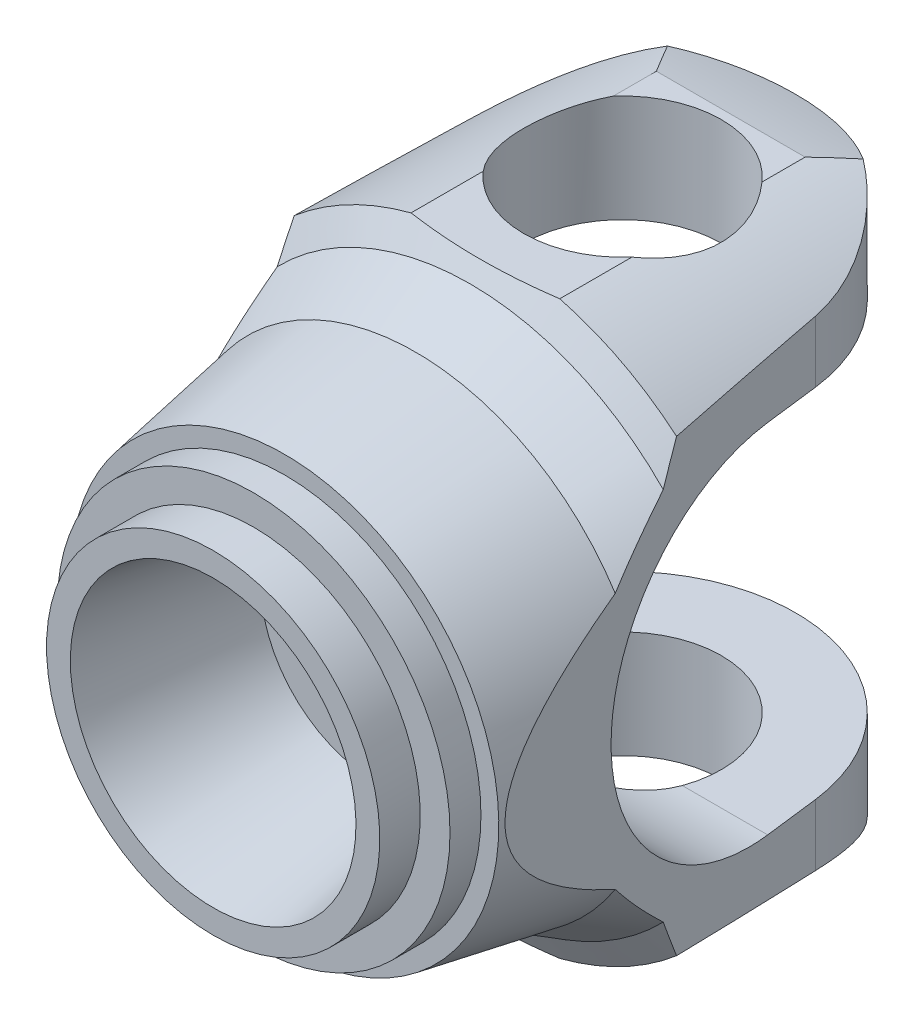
ISO-10303-21;
HEADER;
FILE_DESCRIPTION(('STEP AP214'),'2;1');
FILE_NAME('part.step','',(''),(''),'','','');
FILE_SCHEMA(('AUTOMOTIVE_DESIGN { 1 0 10303 214 1 1 1 1 }'));
ENDSEC;
DATA;
#1=APPLICATION_CONTEXT('core data for automotive mechanical design processes');
#2=APPLICATION_PROTOCOL_DEFINITION('international standard','automotive_design',2000,#1);
#3=PRODUCT_CONTEXT('',#1,'mechanical');
#4=PRODUCT('Part','Part','',(#3));
#5=PRODUCT_RELATED_PRODUCT_CATEGORY('part','',(#4));
#6=PRODUCT_DEFINITION_FORMATION('','',#4);
#7=PRODUCT_DEFINITION_CONTEXT('part definition',#1,'design');
#8=PRODUCT_DEFINITION('design','',#6,#7);
#9=PRODUCT_DEFINITION_SHAPE('','',#8);
#10=(LENGTH_UNIT() NAMED_UNIT(*) SI_UNIT(.MILLI.,.METRE.));
#11=(NAMED_UNIT(*) PLANE_ANGLE_UNIT() SI_UNIT($,.RADIAN.));
#12=(NAMED_UNIT(*) SI_UNIT($,.STERADIAN.) SOLID_ANGLE_UNIT());
#13=UNCERTAINTY_MEASURE_WITH_UNIT(LENGTH_MEASURE(1.E-05),#10,'distance_accuracy_value','');
#14=(GEOMETRIC_REPRESENTATION_CONTEXT(3) GLOBAL_UNCERTAINTY_ASSIGNED_CONTEXT((#13)) GLOBAL_UNIT_ASSIGNED_CONTEXT((#10,
#11,#12)) REPRESENTATION_CONTEXT('',''));
#15=CARTESIAN_POINT('',(0.,0.,0.));
#16=DIRECTION('',(0.,0.,1.));
#17=DIRECTION('',(1.,0.,0.));
#18=AXIS2_PLACEMENT_3D('',#15,#16,#17);
#19=CARTESIAN_POINT('',(-206.868607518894,325.084972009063,261.134521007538));
#20=DIRECTION('',(0.,-1.,0.));
#21=DIRECTION('',(-1.,0.,0.));
#22=AXIS2_PLACEMENT_3D('',#19,#20,#21);
#23=PLANE('',#22);
#24=CARTESIAN_POINT('',(-282.817976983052,325.08497200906,247.134476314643));
#25=DIRECTION('',(0.,1.,0.));
#26=DIRECTION('',(-1.,0.,0.));
#27=AXIS2_PLACEMENT_3D('',#24,#25,#26);
#28=CIRCLE('',#27,41.4999999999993);
#29=CARTESIAN_POINT('',(-324.317976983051,325.084972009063,247.134476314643));
#30=VERTEX_POINT('',#29);
#31=CARTESIAN_POINT('',(-321.885210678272,325.084972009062,261.134521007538));
#32=VERTEX_POINT('',#31);
#33=EDGE_CURVE('E9',#30,#32,#28,.T.);
#34=ORIENTED_EDGE('',*,*,#33,.T.);
#35=DIRECTION('',(1.,0.,0.));
#36=VECTOR('',#35,1.);
#37=CARTESIAN_POINT('',(-339.826298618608,325.084972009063,261.134521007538));
#38=LINE('',#37,#36);
#39=CARTESIAN_POINT('',(-357.767386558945,325.084972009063,261.134521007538));
#40=VERTEX_POINT('',#39);
#41=EDGE_CURVE('E177',#40,#32,#38,.T.);
#42=ORIENTED_EDGE('',*,*,#41,.F.);
#43=DIRECTION('',(0.121869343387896,0.,-0.99254615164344));
#44=VECTOR('',#43,1.);
#45=CARTESIAN_POINT('',(-356.364080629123,325.084972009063,249.705511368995));
#46=LINE('',#45,#44);
#47=CARTESIAN_POINT('',(-354.960774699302,325.084972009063,238.276501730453));
#48=VERTEX_POINT('',#47);
#49=EDGE_CURVE('E30',#40,#48,#46,.T.);
#50=ORIENTED_EDGE('',*,*,#49,.T.);
#51=CARTESIAN_POINT('',(-282.817997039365,325.084972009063,247.134521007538));
#52=DIRECTION('',(0.,1.,0.));
#53=DIRECTION('',(0.,0.,1.));
#54=AXIS2_PLACEMENT_3D('',#51,#52,#53);
#55=CIRCLE('',#54,72.6845573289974);
#56=CARTESIAN_POINT('',(-210.675219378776,325.084972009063,238.276501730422));
#57=VERTEX_POINT('',#56);
#58=EDGE_CURVE('E172',#57,#48,#55,.T.);
#59=ORIENTED_EDGE('',*,*,#58,.F.);
#60=DIRECTION('',(0.121869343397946,0.,0.992546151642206));
#61=VECTOR('',#60,1.);
#62=CARTESIAN_POINT('',(-209.271913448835,325.084972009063,249.70551136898));
#63=LINE('',#62,#61);
#64=CARTESIAN_POINT('',(-207.868607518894,325.084972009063,261.134521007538));
#65=VERTEX_POINT('',#64);
#66=EDGE_CURVE('E182',#57,#65,#63,.T.);
#67=ORIENTED_EDGE('',*,*,#66,.T.);
#68=DIRECTION('',(1.,0.,0.));
#69=VECTOR('',#68,1.);
#70=CARTESIAN_POINT('',(-225.809675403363,325.084972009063,261.134521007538));
#71=LINE('',#70,#69);
#72=CARTESIAN_POINT('',(-243.750743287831,325.084972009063,261.134521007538));
#73=VERTEX_POINT('',#72);
#74=EDGE_CURVE('E183',#73,#65,#71,.T.);
#75=ORIENTED_EDGE('',*,*,#74,.F.);
#76=CARTESIAN_POINT('',(-282.817976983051,325.084972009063,247.134476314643));
#77=DIRECTION('',(0.,1.,0.));
#78=DIRECTION('',(0.,0.,1.));
#79=AXIS2_PLACEMENT_3D('',#76,#77,#78);
#80=CIRCLE('',#79,41.5000000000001);
#81=EDGE_CURVE('E145',#73,#30,#80,.T.);
#82=ORIENTED_EDGE('',*,*,#81,.T.);
#83=EDGE_LOOP('',(#34,#42,#50,#59,#67,#75,#82));
#84=FACE_BOUND('',#83,.T.);
#85=ADVANCED_FACE('F14',(#84),#23,.T.);
#86=CARTESIAN_POINT('',(-282.817976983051,370.084972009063,247.134476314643));
#87=DIRECTION('',(0.,-1.,0.));
#88=DIRECTION('',(0.,0.,-1.));
#89=AXIS2_PLACEMENT_3D('',#86,#87,#88);
#90=CYLINDRICAL_SURFACE('',#89,41.5);
#91=CARTESIAN_POINT('',(-321.885210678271,325.084972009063,261.134521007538));
#92=CARTESIAN_POINT('',(-321.694671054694,325.084983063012,261.666257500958));
#93=CARTESIAN_POINT('',(-321.49326015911,325.079317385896,262.194078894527));
#94=CARTESIAN_POINT('',(-321.069168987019,325.057213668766,263.240839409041));
#95=CARTESIAN_POINT('',(-320.846490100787,325.040776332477,263.759779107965));
#96=CARTESIAN_POINT('',(-320.380444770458,324.997722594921,264.787499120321));
#97=CARTESIAN_POINT('',(-320.137090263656,324.971112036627,265.296285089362));
#98=CARTESIAN_POINT('',(-319.630127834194,324.908371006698,266.303026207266));
#99=CARTESIAN_POINT('',(-319.366519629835,324.872240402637,266.800981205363));
#100=CARTESIAN_POINT('',(-318.548182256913,324.750903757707,268.273533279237));
#101=CARTESIAN_POINT('',(-317.964062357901,324.652569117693,269.230953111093));
#102=CARTESIAN_POINT('',(-316.722134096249,324.426809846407,271.093010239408));
#103=CARTESIAN_POINT('',(-316.064316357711,324.299381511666,271.997640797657));
#104=CARTESIAN_POINT('',(-314.681074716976,324.02213875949,273.74714309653));
#105=CARTESIAN_POINT('',(-313.9557813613,323.872367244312,274.592124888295));
#106=CARTESIAN_POINT('',(-312.441384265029,323.556940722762,276.219512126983));
#107=CARTESIAN_POINT('',(-311.652282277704,323.391286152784,277.001919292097));
#108=CARTESIAN_POINT('',(-310.014140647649,323.050719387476,278.500901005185));
#109=CARTESIAN_POINT('',(-309.165037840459,322.875797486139,279.217404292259));
#110=CARTESIAN_POINT('',(-307.412422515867,322.52372562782,280.579885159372));
#111=CARTESIAN_POINT('',(-306.508907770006,322.34657557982,281.225859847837));
#112=CARTESIAN_POINT('',(-304.602153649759,321.987404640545,282.476645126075));
#113=CARTESIAN_POINT('',(-303.596163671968,321.805638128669,283.077342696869));
#114=CARTESIAN_POINT('',(-301.535200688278,321.454971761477,284.192380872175));
#115=CARTESIAN_POINT('',(-300.480225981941,321.286072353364,284.706718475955));
#116=CARTESIAN_POINT('',(-298.328252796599,320.968559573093,285.644975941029));
#117=CARTESIAN_POINT('',(-297.23126905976,320.819939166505,286.068927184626));
#118=CARTESIAN_POINT('',(-295.002266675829,320.549600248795,286.822977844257));
#119=CARTESIAN_POINT('',(-293.870249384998,320.427880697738,287.15308088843));
#120=CARTESIAN_POINT('',(-291.59693521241,320.218628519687,287.71191768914));
#121=CARTESIAN_POINT('',(-290.45604864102,320.130599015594,287.942132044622));
#122=CARTESIAN_POINT('',(-288.156785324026,319.990222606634,288.30608982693));
#123=CARTESIAN_POINT('',(-286.998408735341,319.937875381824,288.439834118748));
#124=CARTESIAN_POINT('',(-284.673821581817,319.871383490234,288.609329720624));
#125=CARTESIAN_POINT('',(-283.507613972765,319.857225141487,288.645116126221));
#126=CARTESIAN_POINT('',(-281.176533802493,319.867762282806,288.61837888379));
#127=CARTESIAN_POINT('',(-280.011661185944,319.892456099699,288.555859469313));
#128=CARTESIAN_POINT('',(-277.764331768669,319.976798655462,288.340123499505));
#129=CARTESIAN_POINT('',(-276.681223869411,320.034197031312,288.192740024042));
#130=CARTESIAN_POINT('',(-274.532057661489,320.179711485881,287.813514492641));
#131=CARTESIAN_POINT('',(-273.465998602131,320.267826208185,287.581676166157));
#132=CARTESIAN_POINT('',(-271.35770758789,320.471190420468,287.035582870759));
#133=CARTESIAN_POINT('',(-270.315479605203,320.586444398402,286.721314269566));
#134=CARTESIAN_POINT('',(-268.261346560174,320.839516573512,286.012940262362));
#135=CARTESIAN_POINT('',(-267.24944260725,320.977335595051,285.61883193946));
#136=CARTESIAN_POINT('',(-265.236983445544,321.273903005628,284.742889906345));
#137=CARTESIAN_POINT('',(-264.237336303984,321.433086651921,284.25911828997));
#138=CARTESIAN_POINT('',(-262.281523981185,321.763391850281,283.214021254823));
#139=CARTESIAN_POINT('',(-261.325359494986,321.934513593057,282.652694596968));
#140=CARTESIAN_POINT('',(-259.461034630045,322.282252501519,281.45548041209));
#141=CARTESIAN_POINT('',(-258.552907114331,322.458873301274,280.8195427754));
#142=CARTESIAN_POINT('',(-256.79025081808,322.810739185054,279.476939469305));
#143=CARTESIAN_POINT('',(-255.935722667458,322.98598425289,278.770272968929));
#144=CARTESIAN_POINT('',(-254.233578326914,323.338938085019,277.243761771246));
#145=CARTESIAN_POINT('',(-253.389709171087,323.516120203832,276.419608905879));
#146=CARTESIAN_POINT('',(-251.773438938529,323.853087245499,274.700374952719));
#147=CARTESIAN_POINT('',(-251.001049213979,324.012869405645,273.805282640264));
#148=CARTESIAN_POINT('',(-249.53491623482,324.306756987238,271.951450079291));
#149=CARTESIAN_POINT('',(-248.841039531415,324.440906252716,270.992822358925));
#150=CARTESIAN_POINT('',(-247.536295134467,324.676203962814,269.017180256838));
#151=CARTESIAN_POINT('',(-246.925385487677,324.77736912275,268.000195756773));
#152=CARTESIAN_POINT('',(-246.104711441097,324.894929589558,266.49085222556));
#153=CARTESIAN_POINT('',(-245.859591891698,324.927299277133,266.018626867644));
#154=CARTESIAN_POINT('',(-245.387542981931,324.983444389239,265.064773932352));
#155=CARTESIAN_POINT('',(-245.160608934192,325.007222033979,264.583148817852));
#156=CARTESIAN_POINT('',(-244.72548040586,325.045630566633,263.611575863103));
#157=CARTESIAN_POINT('',(-244.517272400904,325.060268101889,263.121634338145));
#158=CARTESIAN_POINT('',(-244.11973257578,325.079944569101,262.133796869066));
#159=CARTESIAN_POINT('',(-243.930406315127,325.084980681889,261.635898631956));
#160=CARTESIAN_POINT('',(-243.750743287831,325.084972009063,261.134521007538));
#161=B_SPLINE_CURVE_WITH_KNOTS('',3,(#91,#92,#93,#94,#95,#96,#97,#98,#99,#100,#101,#102,#103,
#104,#105,#106,#107,#108,#109,#110,#111,#112,#113,#114,#115,#116,#117,#118,#119,#120,#121,#122,
#123,#124,#125,#126,#127,#128,#129,#130,#131,#132,#133,#134,#135,#136,#137,#138,#139,#140,#141,
#142,#143,#144,#145,#146,#147,#148,#149,#150,#151,#152,#153,#154,#155,#156,#157,#158,#159,#160),
.UNSPECIFIED.,.F.,.F.,(4,2,2,2,2,2,2,2,2,2,2,2,2,2,2,2,2,2,2,2,2,2,2,2,2,2,2,2,2,2,2,2,2,2,4),
(0.,1.69435712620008,3.38860356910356,5.08187838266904,6.7751767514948,10.1481827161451,
13.5216182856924,16.888657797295,20.2556048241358,23.6261507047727,26.9968347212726,
30.5497329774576,34.1027546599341,37.6545407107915,41.206189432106,44.7032284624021,
48.2002361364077,51.6959907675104,55.1915948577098,58.4715535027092,61.7513673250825,
65.0317239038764,68.3122003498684,71.6742592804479,75.0363719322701,78.4007556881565,
81.7651789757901,85.3391983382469,88.9137843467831,92.4822003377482,96.0488051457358,
97.6475527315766,99.2458869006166,100.843057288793,102.440696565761),.UNSPECIFIED.);
#162=EDGE_CURVE('E39',#32,#73,#161,.T.);
#163=ORIENTED_EDGE('',*,*,#162,.F.);
#164=ORIENTED_EDGE('',*,*,#33,.F.);
#165=DIRECTION('',(0.,1.,0.));
#166=VECTOR('',#165,1.);
#167=CARTESIAN_POINT('',(-324.317976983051,346.009606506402,247.134476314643));
#168=LINE('',#167,#166);
#169=CARTESIAN_POINT('',(-324.317976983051,366.934241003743,247.134476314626));
#170=VERTEX_POINT('',#169);
#171=EDGE_CURVE('E142',#30,#170,#168,.T.);
#172=ORIENTED_EDGE('',*,*,#171,.T.);
#173=CARTESIAN_POINT('',(-314.058993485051,370.084972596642,274.452032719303));
#174=CARTESIAN_POINT('',(-314.435853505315,369.986859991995,274.021042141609));
#175=CARTESIAN_POINT('',(-314.803802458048,369.889172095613,273.582250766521));
#176=CARTESIAN_POINT('',(-315.521387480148,369.695282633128,272.689612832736));
#177=CARTESIAN_POINT('',(-315.871023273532,369.59908108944,272.23576604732));
#178=CARTESIAN_POINT('',(-316.891723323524,369.313661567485,270.852461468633));
#179=CARTESIAN_POINT('',(-317.534563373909,369.127633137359,269.901258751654));
#180=CARTESIAN_POINT('',(-318.742425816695,368.768728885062,267.94342293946));
#181=CARTESIAN_POINT('',(-319.307149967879,368.595904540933,266.936596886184));
#182=CARTESIAN_POINT('',(-320.351775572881,368.269213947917,264.876991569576));
#183=CARTESIAN_POINT('',(-320.831687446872,368.115345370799,263.824217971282));
#184=CARTESIAN_POINT('',(-321.703721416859,367.830933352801,261.677311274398));
#185=CARTESIAN_POINT('',(-322.095663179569,367.70043793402,260.583098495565));
#186=CARTESIAN_POINT('',(-322.787091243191,367.467274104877,258.362657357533));
#187=CARTESIAN_POINT('',(-323.08655973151,367.364611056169,257.236422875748));
#188=CARTESIAN_POINT('',(-323.589180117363,367.190826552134,254.964432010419));
#189=CARTESIAN_POINT('',(-323.792662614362,367.119596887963,253.818756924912));
#190=CARTESIAN_POINT('',(-324.102678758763,367.010599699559,251.513341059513));
#191=CARTESIAN_POINT('',(-324.209280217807,366.972808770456,250.353610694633));
#192=CARTESIAN_POINT('',(-324.283970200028,366.946313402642,248.848929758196));
#193=CARTESIAN_POINT('',(-324.296725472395,366.941786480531,248.50606340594));
#194=CARTESIAN_POINT('',(-324.313724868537,366.93575178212,247.820303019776));
#195=CARTESIAN_POINT('',(-324.317974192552,366.934242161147,247.477409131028));
#196=CARTESIAN_POINT('',(-324.317976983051,366.934241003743,247.134476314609));
#197=B_SPLINE_CURVE_WITH_KNOTS('',3,(#173,#174,#175,#176,#177,#178,#179,#180,#181,#182,#183,
#184,#185,#186,#187,#188,#189,#190,#191,#192,#193,#194,#195,#196),.UNSPECIFIED.,.F.,.F.,(4,2,2,
2,2,2,2,2,2,2,2,4),(0.,1.74233819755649,3.48470264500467,6.96950935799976,10.4672737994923,
13.9646082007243,17.4690477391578,20.9741618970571,24.4671138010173,27.9576189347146,
28.9869394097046,30.0156304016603),.UNSPECIFIED.);
#198=CARTESIAN_POINT('',(-314.058994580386,370.084972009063,274.452031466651));
#199=VERTEX_POINT('',#198);
#200=EDGE_CURVE('E141',#199,#170,#197,.T.);
#201=ORIENTED_EDGE('',*,*,#200,.F.);
#202=CARTESIAN_POINT('',(-282.817976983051,370.084972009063,247.134476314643));
#203=DIRECTION('',(0.,1.,0.));
#204=DIRECTION('',(0.,0.,1.));
#205=AXIS2_PLACEMENT_3D('',#202,#203,#204);
#206=CIRCLE('',#205,41.4999999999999);
#207=CARTESIAN_POINT('',(-251.576998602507,370.084972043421,274.452076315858));
#208=VERTEX_POINT('',#207);
#209=EDGE_CURVE('E122',#199,#208,#206,.T.);
#210=ORIENTED_EDGE('',*,*,#209,.T.);
#211=CARTESIAN_POINT('',(-251.576999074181,370.084972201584,219.816875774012));
#212=CARTESIAN_POINT('',(-251.19973452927,369.986754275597,220.248327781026));
#213=CARTESIAN_POINT('',(-250.831400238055,369.888961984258,220.68759719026));
#214=CARTESIAN_POINT('',(-250.113084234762,369.694867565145,221.581222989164));
#215=CARTESIAN_POINT('',(-249.763102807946,369.598565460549,222.035579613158));
#216=CARTESIAN_POINT('',(-248.741463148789,369.312862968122,223.420410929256));
#217=CARTESIAN_POINT('',(-248.098087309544,369.126660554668,224.372672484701));
#218=CARTESIAN_POINT('',(-246.890587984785,368.767822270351,226.33067420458));
#219=CARTESIAN_POINT('',(-246.326595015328,368.595208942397,227.336498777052));
#220=CARTESIAN_POINT('',(-245.283227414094,368.268896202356,229.39404885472));
#221=CARTESIAN_POINT('',(-244.803846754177,368.115195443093,230.445771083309));
#222=CARTESIAN_POINT('',(-243.932752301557,367.831089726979,232.590358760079));
#223=CARTESIAN_POINT('',(-243.541206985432,367.700729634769,233.683298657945));
#224=CARTESIAN_POINT('',(-242.850415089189,367.467787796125,235.900924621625));
#225=CARTESIAN_POINT('',(-242.551170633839,367.365206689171,237.025611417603));
#226=CARTESIAN_POINT('',(-242.048181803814,367.191304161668,239.297054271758));
#227=CARTESIAN_POINT('',(-241.844318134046,367.119943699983,240.443780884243));
#228=CARTESIAN_POINT('',(-241.533615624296,367.010705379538,242.751865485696));
#229=CARTESIAN_POINT('',(-241.426772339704,366.972825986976,243.913222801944));
#230=CARTESIAN_POINT('',(-241.313426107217,366.932624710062,246.196921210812));
#231=CARTESIAN_POINT('',(-241.303246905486,366.929000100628,247.319058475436));
#232=CARTESIAN_POINT('',(-241.373760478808,366.95402983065,249.560101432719));
#233=CARTESIAN_POINT('',(-241.45445171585,366.982683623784,250.679007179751));
#234=CARTESIAN_POINT('',(-241.705984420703,367.071382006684,252.906004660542));
#235=CARTESIAN_POINT('',(-241.876877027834,367.131444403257,254.014089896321));
#236=CARTESIAN_POINT('',(-242.307212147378,367.281081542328,256.210856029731));
#237=CARTESIAN_POINT('',(-242.566652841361,367.370655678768,257.299537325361));
#238=CARTESIAN_POINT('',(-243.167637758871,367.575176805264,259.435487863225));
#239=CARTESIAN_POINT('',(-243.508024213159,367.68976428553,260.483118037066));
#240=CARTESIAN_POINT('',(-244.269922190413,367.941693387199,262.545713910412));
#241=CARTESIAN_POINT('',(-244.691440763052,368.079036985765,263.56067676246));
#242=CARTESIAN_POINT('',(-245.611951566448,368.372516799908,265.550852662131));
#243=CARTESIAN_POINT('',(-246.110876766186,368.528636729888,266.526099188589));
#244=CARTESIAN_POINT('',(-247.182903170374,368.855564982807,268.432039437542));
#245=CARTESIAN_POINT('',(-247.755977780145,369.026368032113,269.362748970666));
#246=CARTESIAN_POINT('',(-248.60988179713,369.273353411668,270.634491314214));
#247=CARTESIAN_POINT('',(-248.861336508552,369.345261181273,270.99638506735));
#248=CARTESIAN_POINT('',(-249.37546311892,369.490450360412,271.711745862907));
#249=CARTESIAN_POINT('',(-249.638132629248,369.563731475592,272.065214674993));
#250=CARTESIAN_POINT('',(-250.173937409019,369.711233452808,272.762775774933));
#251=CARTESIAN_POINT('',(-250.447050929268,369.785452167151,273.106885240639));
#252=CARTESIAN_POINT('',(-251.004033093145,369.934689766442,273.786229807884));
#253=CARTESIAN_POINT('',(-251.287903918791,370.009708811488,274.121463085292));
#254=CARTESIAN_POINT('',(-251.576998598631,370.084972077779,274.452076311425));
#255=B_SPLINE_CURVE_WITH_KNOTS('',3,(#211,#212,#213,#214,#215,#216,#217,#218,#219,#220,#221,
#222,#223,#224,#225,#226,#227,#228,#229,#230,#231,#232,#233,#234,#235,#236,#237,#238,#239,#240,
#241,#242,#243,#244,#245,#246,#247,#248,#249,#250,#251,#252,#253,#254),.UNSPECIFIED.,.F.,.F.,(4,
2,2,2,2,2,2,2,2,2,2,2,2,2,2,2,2,2,2,2,2,4),(0.,1.74420504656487,3.48843719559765,
6.97679899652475,10.4708307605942,13.9646134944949,17.4650414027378,20.9655498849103,
24.4616684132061,27.9576267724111,31.3200712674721,34.6824588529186,38.0467547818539,
41.4109816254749,44.7297125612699,48.0487319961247,51.3648931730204,54.6798682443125,
56.0192236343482,57.3582951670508,58.6947156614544,60.0314087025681),.UNSPECIFIED.);
#256=CARTESIAN_POINT('',(-251.576999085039,370.084972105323,219.816875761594));
#257=VERTEX_POINT('',#256);
#258=EDGE_CURVE('E129',#257,#208,#255,.T.);
#259=ORIENTED_EDGE('',*,*,#258,.F.);
#260=CARTESIAN_POINT('',(-282.817976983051,370.084972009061,247.134476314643));
#261=DIRECTION('',(0.,1.,0.));
#262=DIRECTION('',(0.,0.,1.));
#263=AXIS2_PLACEMENT_3D('',#260,#261,#262);
#264=CIRCLE('',#263,41.4999999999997);
#265=CARTESIAN_POINT('',(-314.058989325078,370.08497283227,219.816915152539));
#266=VERTEX_POINT('',#265);
#267=EDGE_CURVE('E143',#257,#266,#264,.T.);
#268=ORIENTED_EDGE('',*,*,#267,.T.);
#269=CARTESIAN_POINT('',(-324.317976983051,366.934241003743,247.134476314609));
#270=CARTESIAN_POINT('',(-324.317986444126,366.934229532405,246.569105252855));
#271=CARTESIAN_POINT('',(-324.30642366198,366.938344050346,246.003741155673));
#272=CARTESIAN_POINT('',(-324.260225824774,366.954740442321,244.874084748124));
#273=CARTESIAN_POINT('',(-324.225591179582,366.967022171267,244.309792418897));
#274=CARTESIAN_POINT('',(-324.133332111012,366.999664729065,243.183442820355));
#275=CARTESIAN_POINT('',(-324.075712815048,367.020023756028,242.621385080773));
#276=CARTESIAN_POINT('',(-323.937642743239,367.068646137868,241.500464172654));
#277=CARTESIAN_POINT('',(-323.857191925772,367.096909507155,240.941601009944));
#278=CARTESIAN_POINT('',(-323.582028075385,367.193179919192,239.272390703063));
#279=CARTESIAN_POINT('',(-323.353393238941,367.272706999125,238.16807996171));
#280=CARTESIAN_POINT('',(-322.80781986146,367.459998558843,235.984147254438));
#281=CARTESIAN_POINT('',(-322.490881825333,367.56776287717,234.90452514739));
#282=CARTESIAN_POINT('',(-321.771664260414,367.808187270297,232.777607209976));
#283=CARTESIAN_POINT('',(-321.3694314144,367.94083372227,231.730294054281));
#284=CARTESIAN_POINT('',(-320.482726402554,368.227195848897,229.673931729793));
#285=CARTESIAN_POINT('',(-319.998242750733,368.380914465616,228.664887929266));
#286=CARTESIAN_POINT('',(-318.951522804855,368.704818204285,226.6928191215));
#287=CARTESIAN_POINT('',(-318.389405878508,368.874977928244,225.729726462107));
#288=CARTESIAN_POINT('',(-317.190895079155,369.227296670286,223.853788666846));
#289=CARTESIAN_POINT('',(-316.554538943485,369.40944957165,222.940918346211));
#290=CARTESIAN_POINT('',(-315.591921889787,369.67577927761,221.671738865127));
#291=CARTESIAN_POINT('',(-315.294092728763,369.757034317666,221.292958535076));
#292=CARTESIAN_POINT('',(-314.685925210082,369.92041812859,220.546599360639));
#293=CARTESIAN_POINT('',(-314.375603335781,370.002545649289,220.179006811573));
#294=CARTESIAN_POINT('',(-314.058989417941,370.08497365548,219.816915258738));
#295=B_SPLINE_CURVE_WITH_KNOTS('',3,(#269,#270,#271,#272,#273,#274,#275,#276,#277,#278,#279,
#280,#281,#282,#283,#284,#285,#286,#287,#288,#289,#290,#291,#292,#293,#294),.UNSPECIFIED.,.F.,
.F.,(4,2,2,2,2,2,2,2,2,2,2,2,4),(0.,1.69596705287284,3.39190397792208,5.08746278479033,
6.7830246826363,10.1701181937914,13.5571923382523,16.9424174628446,20.3281157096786,
23.7086649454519,27.087503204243,28.553218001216,30.0170584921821),.UNSPECIFIED.);
#296=EDGE_CURVE('E156',#170,#266,#295,.T.);
#297=ORIENTED_EDGE('',*,*,#296,.F.);
#298=ORIENTED_EDGE('',*,*,#171,.F.);
#299=ORIENTED_EDGE('',*,*,#81,.F.);
#300=EDGE_LOOP('',(#163,#164,#172,#201,#210,#259,#268,#297,#298,#299));
#301=FACE_BOUND('',#300,.T.);
#302=ADVANCED_FACE('F138',(#301),#90,.F.);
#303=CARTESIAN_POINT('',(-182.817997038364,250.084972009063,261.134521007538));
#304=DIRECTION('',(-1.,0.,0.));
#305=DIRECTION('',(0.,-1.,0.));
#306=AXIS2_PLACEMENT_3D('',#303,#304,#305);
#307=CYLINDRICAL_SURFACE('',#306,75.);
#308=CARTESIAN_POINT('',(-243.750743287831,175.084972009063,261.134521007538));
#309=CARTESIAN_POINT('',(-243.941282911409,175.084960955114,261.666257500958));
#310=CARTESIAN_POINT('',(-244.142693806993,175.090626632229,262.194078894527));
#311=CARTESIAN_POINT('',(-244.566784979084,175.112730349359,263.240839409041));
#312=CARTESIAN_POINT('',(-244.789463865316,175.129167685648,263.759779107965));
#313=CARTESIAN_POINT('',(-245.255509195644,175.172221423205,264.787499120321));
#314=CARTESIAN_POINT('',(-245.498863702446,175.198831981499,265.296285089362));
#315=CARTESIAN_POINT('',(-246.005826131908,175.261573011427,266.303026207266));
#316=CARTESIAN_POINT('',(-246.269434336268,175.297703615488,266.800981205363));
#317=CARTESIAN_POINT('',(-247.087771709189,175.419040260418,268.273533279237));
#318=CARTESIAN_POINT('',(-247.671891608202,175.517374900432,269.230953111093));
#319=CARTESIAN_POINT('',(-248.913819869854,175.743134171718,271.093010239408));
#320=CARTESIAN_POINT('',(-249.571637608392,175.87056250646,271.997640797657));
#321=CARTESIAN_POINT('',(-250.954879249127,176.147805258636,273.74714309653));
#322=CARTESIAN_POINT('',(-251.680172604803,176.297576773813,274.592124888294));
#323=CARTESIAN_POINT('',(-253.194569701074,176.613003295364,276.219512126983));
#324=CARTESIAN_POINT('',(-253.983671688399,176.778657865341,277.001919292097));
#325=CARTESIAN_POINT('',(-255.621813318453,177.119224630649,278.500901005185));
#326=CARTESIAN_POINT('',(-256.470916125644,177.294146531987,279.217404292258));
#327=CARTESIAN_POINT('',(-258.223531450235,177.646218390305,280.579885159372));
#328=CARTESIAN_POINT('',(-259.127046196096,177.823368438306,281.225859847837));
#329=CARTESIAN_POINT('',(-261.033800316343,178.18253937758,282.476645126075));
#330=CARTESIAN_POINT('',(-262.039790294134,178.364305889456,283.077342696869));
#331=CARTESIAN_POINT('',(-264.100753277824,178.714972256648,284.192380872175));
#332=CARTESIAN_POINT('',(-265.155727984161,178.883871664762,284.706718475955));
#333=CARTESIAN_POINT('',(-267.307701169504,179.201384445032,285.644975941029));
#334=CARTESIAN_POINT('',(-268.404684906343,179.350004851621,286.068927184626));
#335=CARTESIAN_POINT('',(-270.633687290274,179.62034376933,286.822977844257));
#336=CARTESIAN_POINT('',(-271.765704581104,179.742063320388,287.15308088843));
#337=CARTESIAN_POINT('',(-274.039018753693,179.951315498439,287.71191768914));
#338=CARTESIAN_POINT('',(-275.179905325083,180.039345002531,287.942132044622));
#339=CARTESIAN_POINT('',(-277.479168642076,180.179721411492,288.30608982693));
#340=CARTESIAN_POINT('',(-278.637545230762,180.232068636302,288.439834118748));
#341=CARTESIAN_POINT('',(-280.962132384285,180.298560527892,288.609329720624));
#342=CARTESIAN_POINT('',(-282.128339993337,180.312718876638,288.645116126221));
#343=CARTESIAN_POINT('',(-284.459420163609,180.30218173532,288.61837888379));
#344=CARTESIAN_POINT('',(-285.624292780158,180.277487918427,288.555859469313));
#345=CARTESIAN_POINT('',(-287.871622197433,180.193145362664,288.340123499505));
#346=CARTESIAN_POINT('',(-288.954730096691,180.135746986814,288.192740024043));
#347=CARTESIAN_POINT('',(-291.103896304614,179.990232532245,287.813514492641));
#348=CARTESIAN_POINT('',(-292.169955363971,179.902117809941,287.581676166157));
#349=CARTESIAN_POINT('',(-294.278246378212,179.698753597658,287.035582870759));
#350=CARTESIAN_POINT('',(-295.320474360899,179.583499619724,286.721314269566));
#351=CARTESIAN_POINT('',(-297.374607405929,179.330427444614,286.012940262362));
#352=CARTESIAN_POINT('',(-298.386511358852,179.192608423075,285.61883193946));
#353=CARTESIAN_POINT('',(-300.398970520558,178.896041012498,284.742889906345));
#354=CARTESIAN_POINT('',(-301.398617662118,178.736857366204,284.25911828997));
#355=CARTESIAN_POINT('',(-303.354429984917,178.406552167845,283.214021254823));
#356=CARTESIAN_POINT('',(-304.310594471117,178.235430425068,282.652694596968));
#357=CARTESIAN_POINT('',(-306.174919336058,177.887691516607,281.45548041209));
#358=CARTESIAN_POINT('',(-307.083046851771,177.711070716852,280.8195427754));
#359=CARTESIAN_POINT('',(-308.845703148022,177.359204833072,279.476939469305));
#360=CARTESIAN_POINT('',(-309.700231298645,177.183959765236,278.770272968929));
#361=CARTESIAN_POINT('',(-311.402375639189,176.831005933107,277.243761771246));
#362=CARTESIAN_POINT('',(-312.246244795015,176.653823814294,276.419608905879));
#363=CARTESIAN_POINT('',(-313.862515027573,176.316856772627,274.700374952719));
#364=CARTESIAN_POINT('',(-314.634904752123,176.157074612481,273.805282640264));
#365=CARTESIAN_POINT('',(-316.101037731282,175.863187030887,271.951450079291));
#366=CARTESIAN_POINT('',(-316.794914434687,175.72903776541,270.992822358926));
#367=CARTESIAN_POINT('',(-318.099658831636,175.493740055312,269.017180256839));
#368=CARTESIAN_POINT('',(-318.710568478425,175.392574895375,268.000195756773));
#369=CARTESIAN_POINT('',(-319.531242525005,175.275014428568,266.49085222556));
#370=CARTESIAN_POINT('',(-319.776362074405,175.242644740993,266.018626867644));
#371=CARTESIAN_POINT('',(-320.248410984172,175.186499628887,265.064773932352));
#372=CARTESIAN_POINT('',(-320.475345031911,175.162721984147,264.583148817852));
#373=CARTESIAN_POINT('',(-320.910473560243,175.124313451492,263.611575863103));
#374=CARTESIAN_POINT('',(-321.118681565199,175.109675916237,263.121634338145));
#375=CARTESIAN_POINT('',(-321.516221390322,175.089999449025,262.133796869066));
#376=CARTESIAN_POINT('',(-321.705547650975,175.084963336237,261.635898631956));
#377=CARTESIAN_POINT('',(-321.885210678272,175.084972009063,261.134521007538));
#378=B_SPLINE_CURVE_WITH_KNOTS('',3,(#308,#309,#310,#311,#312,#313,#314,#315,#316,#317,#318,
#319,#320,#321,#322,#323,#324,#325,#326,#327,#328,#329,#330,#331,#332,#333,#334,#335,#336,#337,
#338,#339,#340,#341,#342,#343,#344,#345,#346,#347,#348,#349,#350,#351,#352,#353,#354,#355,#356,
#357,#358,#359,#360,#361,#362,#363,#364,#365,#366,#367,#368,#369,#370,#371,#372,#373,#374,#375,
#376,#377),.UNSPECIFIED.,.F.,.F.,(4,2,2,2,2,2,2,2,2,2,2,2,2,2,2,2,2,2,2,2,2,2,2,2,2,2,2,2,2,2,2,
2,2,2,4),(0.,1.69435712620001,3.3886035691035,5.08187838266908,6.77517675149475,10.148182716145,
13.5216182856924,16.8886577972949,20.2556048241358,23.6261507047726,26.9968347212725,
30.5497329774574,34.102754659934,37.6545407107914,41.206189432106,44.7032284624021,
48.2002361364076,51.6959907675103,55.1915948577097,58.4715535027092,61.7513673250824,
65.0317239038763,68.3122003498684,71.6742592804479,75.0363719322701,78.4007556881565,
81.7651789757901,85.3391983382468,88.913784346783,92.482200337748,96.0488051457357,
97.6475527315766,99.2458869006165,100.843057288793,102.440696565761),.UNSPECIFIED.);
#379=CARTESIAN_POINT('',(-243.750743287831,175.084972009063,261.134521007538));
#380=VERTEX_POINT('',#379);
#381=CARTESIAN_POINT('',(-321.885210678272,175.084972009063,261.134521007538));
#382=VERTEX_POINT('',#381);
#383=EDGE_CURVE('E147',#380,#382,#378,.T.);
#384=ORIENTED_EDGE('',*,*,#383,.T.);
#385=DIRECTION('',(-1.,0.,0.));
#386=VECTOR('',#385,1.);
#387=CARTESIAN_POINT('',(-339.826298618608,175.084972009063,261.134521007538));
#388=LINE('',#387,#386);
#389=CARTESIAN_POINT('',(-357.767386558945,175.084972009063,261.134521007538));
#390=VERTEX_POINT('',#389);
#391=EDGE_CURVE('E173',#382,#390,#388,.T.);
#392=ORIENTED_EDGE('',*,*,#391,.T.);
#393=CARTESIAN_POINT('',(-357.767386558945,175.084972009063,261.134521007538));
#394=CARTESIAN_POINT('',(-373.717568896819,175.084972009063,391.038331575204));
#395=CARTESIAN_POINT('',(-365.742477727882,287.584972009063,326.086426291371));
#396=CARTESIAN_POINT('',(-363.084114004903,325.084972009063,304.43579119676));
#397=CARTESIAN_POINT('',(-357.767386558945,325.084972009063,261.134521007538));
#398=(BOUNDED_CURVE() B_SPLINE_CURVE(2,(#393,#394,#395,#396,#397),.UNSPECIFIED.,.F.,
.F.) B_SPLINE_CURVE_WITH_KNOTS((3,2,3),(0.,0.666666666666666,1.),
.UNSPECIFIED.) CURVE() GEOMETRIC_REPRESENTATION_ITEM() RATIONAL_B_SPLINE_CURVE((1.,0.5,1.,0.75,0.75)) REPRESENTATION_ITEM(''));
#399=EDGE_CURVE('E175',#390,#40,#398,.T.);
#400=ORIENTED_EDGE('',*,*,#399,.T.);
#401=ORIENTED_EDGE('',*,*,#41,.T.);
#402=ORIENTED_EDGE('',*,*,#162,.T.);
#403=ORIENTED_EDGE('',*,*,#74,.T.);
#404=CARTESIAN_POINT('',(-207.868607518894,325.084972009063,261.134521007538));
#405=CARTESIAN_POINT('',(-202.551880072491,325.084972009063,304.43579119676));
#406=CARTESIAN_POINT('',(-199.89351634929,287.584972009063,326.086426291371));
#407=CARTESIAN_POINT('',(-191.918425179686,175.084972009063,391.038331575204));
#408=CARTESIAN_POINT('',(-207.868607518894,175.084972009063,261.134521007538));
#409=(BOUNDED_CURVE() B_SPLINE_CURVE(2,(#404,#405,#406,#407,#408),.UNSPECIFIED.,.F.,
.F.) B_SPLINE_CURVE_WITH_KNOTS((3,2,3),(0.,0.333333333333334,1.),
.UNSPECIFIED.) CURVE() GEOMETRIC_REPRESENTATION_ITEM() RATIONAL_B_SPLINE_CURVE((0.75,0.75,1.,
0.5,1.)) REPRESENTATION_ITEM(''));
#410=CARTESIAN_POINT('',(-207.868607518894,175.084972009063,261.134521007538));
#411=VERTEX_POINT('',#410);
#412=EDGE_CURVE('E166',#65,#411,#409,.T.);
#413=ORIENTED_EDGE('',*,*,#412,.T.);
#414=DIRECTION('',(-1.,0.,0.));
#415=VECTOR('',#414,1.);
#416=CARTESIAN_POINT('',(-225.809675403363,175.084972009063,261.134521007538));
#417=LINE('',#416,#415);
#418=EDGE_CURVE('E163',#411,#380,#417,.T.);
#419=ORIENTED_EDGE('',*,*,#418,.T.);
#420=EDGE_LOOP('',(#384,#392,#400,#401,#402,#403,#413,#419));
#421=FACE_BOUND('',#420,.T.);
#422=ADVANCED_FACE('F334',(#421),#307,.F.);
#423=CARTESIAN_POINT('',(-282.817976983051,370.084972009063,247.134476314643));
#424=DIRECTION('',(0.,-1.,0.));
#425=DIRECTION('',(0.,0.,-1.));
#426=AXIS2_PLACEMENT_3D('',#423,#424,#425);
#427=CYLINDRICAL_SURFACE('',#426,41.5);
#428=ORIENTED_EDGE('',*,*,#383,.F.);
#429=CARTESIAN_POINT('',(-282.817976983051,175.084972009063,247.134476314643));
#430=DIRECTION('',(0.,-1.,0.));
#431=DIRECTION('',(0.,0.,-1.));
#432=AXIS2_PLACEMENT_3D('',#429,#430,#431);
#433=CIRCLE('',#432,41.5000000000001);
#434=CARTESIAN_POINT('',(-324.317976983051,175.084972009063,247.134476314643));
#435=VERTEX_POINT('',#434);
#436=EDGE_CURVE('E158',#435,#380,#433,.T.);
#437=ORIENTED_EDGE('',*,*,#436,.F.);
#438=DIRECTION('',(0.,1.,0.));
#439=VECTOR('',#438,1.);
#440=CARTESIAN_POINT('',(-324.317976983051,154.160337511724,247.134476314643));
#441=LINE('',#440,#439);
#442=CARTESIAN_POINT('',(-324.317976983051,133.235703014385,247.134476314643));
#443=VERTEX_POINT('',#442);
#444=EDGE_CURVE('E161',#443,#435,#441,.T.);
#445=ORIENTED_EDGE('',*,*,#444,.F.);
#446=CARTESIAN_POINT('',(-314.058995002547,130.084971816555,219.816921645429));
#447=CARTESIAN_POINT('',(-314.435854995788,130.183084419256,220.247912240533));
#448=CARTESIAN_POINT('',(-314.803803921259,130.280772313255,220.686703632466));
#449=CARTESIAN_POINT('',(-315.521388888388,130.474661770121,221.579341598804));
#450=CARTESIAN_POINT('',(-315.871024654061,130.570863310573,222.03318839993));
#451=CARTESIAN_POINT('',(-316.89172462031,130.856282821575,223.416493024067));
#452=CARTESIAN_POINT('',(-317.534564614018,131.04231124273,224.367695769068));
#453=CARTESIAN_POINT('',(-318.742426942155,131.40121547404,226.325531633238));
#454=CARTESIAN_POINT('',(-319.307151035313,131.574039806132,227.332357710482));
#455=CARTESIAN_POINT('',(-320.351776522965,131.900730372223,229.391963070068));
#456=CARTESIAN_POINT('',(-320.831688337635,132.054598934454,230.444736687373));
#457=CARTESIAN_POINT('',(-321.703722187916,132.339010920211,232.591643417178));
#458=CARTESIAN_POINT('',(-322.095663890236,132.469506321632,233.685856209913));
#459=CARTESIAN_POINT('',(-322.787091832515,132.702670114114,235.906297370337));
#460=CARTESIAN_POINT('',(-323.086560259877,132.805333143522,237.032531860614));
#461=CARTESIAN_POINT('',(-323.589180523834,132.979117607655,239.304522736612));
#462=CARTESIAN_POINT('',(-323.792662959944,133.050347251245,240.450197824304));
#463=CARTESIAN_POINT('',(-324.102678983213,133.159344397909,242.755613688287));
#464=CARTESIAN_POINT('',(-324.209280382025,133.197135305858,243.915344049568));
#465=CARTESIAN_POINT('',(-324.283970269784,133.223630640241,245.42002462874));
#466=CARTESIAN_POINT('',(-324.296725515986,133.228157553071,245.7628906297));
#467=CARTESIAN_POINT('',(-324.313724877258,133.234192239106,246.448650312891));
#468=CARTESIAN_POINT('',(-324.317974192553,133.235701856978,246.791543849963));
#469=CARTESIAN_POINT('',(-324.317976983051,133.235703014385,247.134476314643));
#470=B_SPLINE_CURVE_WITH_KNOTS('',3,(#446,#447,#448,#449,#450,#451,#452,#453,#454,#455,#456,
#457,#458,#459,#460,#461,#462,#463,#464,#465,#466,#467,#468,#469),.UNSPECIFIED.,.F.,.F.,(4,2,2,
2,2,2,2,2,2,2,2,4),(0.,1.7423381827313,3.48470261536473,6.96950929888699,10.4672737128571,
13.9646080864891,17.4690475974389,20.9741617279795,24.4671136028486,27.9576187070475,
28.9869381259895,30.015628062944),.UNSPECIFIED.);
#471=CARTESIAN_POINT('',(-314.058994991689,130.084971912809,219.816921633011));
#472=VERTEX_POINT('',#471);
#473=EDGE_CURVE('E226',#472,#443,#470,.T.);
#474=ORIENTED_EDGE('',*,*,#473,.F.);
#475=CARTESIAN_POINT('',(-282.817976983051,130.084972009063,247.134476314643));
#476=DIRECTION('',(0.,-1.,0.));
#477=DIRECTION('',(1.,0.,0.));
#478=AXIS2_PLACEMENT_3D('',#475,#476,#477);
#479=CIRCLE('',#478,41.5);
#480=CARTESIAN_POINT('',(-251.577004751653,130.084971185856,219.816869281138));
#481=VERTEX_POINT('',#480);
#482=EDGE_CURVE('E167',#472,#481,#479,.T.);
#483=ORIENTED_EDGE('',*,*,#482,.T.);
#484=CARTESIAN_POINT('',(-251.577000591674,130.084971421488,274.452078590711));
#485=CARTESIAN_POINT('',(-251.199736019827,130.183189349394,274.020626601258));
#486=CARTESIAN_POINT('',(-250.831401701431,130.280981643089,273.581357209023));
#487=CARTESIAN_POINT('',(-250.113085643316,130.47507606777,272.687731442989));
#488=CARTESIAN_POINT('',(-249.763104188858,130.571378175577,272.233374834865));
#489=CARTESIAN_POINT('',(-248.741464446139,130.857080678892,270.848543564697));
#490=CARTESIAN_POINT('',(-248.098088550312,131.043283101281,269.896282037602));
#491=CARTESIAN_POINT('',(-246.890589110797,131.402121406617,267.938280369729));
#492=CARTESIAN_POINT('',(-246.326596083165,131.574734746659,266.932455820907));
#493=CARTESIAN_POINT('',(-245.283228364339,131.901047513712,264.874905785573));
#494=CARTESIAN_POINT('',(-244.803847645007,132.054748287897,263.823183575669));
#495=CARTESIAN_POINT('',(-243.932753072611,132.338854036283,261.678595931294));
#496=CARTESIAN_POINT('',(-243.54120769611,132.469214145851,260.585656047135));
#497=CARTESIAN_POINT('',(-242.850415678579,132.702156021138,258.368030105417));
#498=CARTESIAN_POINT('',(-242.551171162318,132.804737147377,257.243343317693));
#499=CARTESIAN_POINT('',(-242.048182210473,132.978639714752,254.971900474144));
#500=CARTESIAN_POINT('',(-241.844318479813,133.050000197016,253.825173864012));
#501=CARTESIAN_POINT('',(-241.533615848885,133.159238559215,251.517089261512));
#502=CARTESIAN_POINT('',(-241.426772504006,133.197117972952,250.355731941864));
#503=CARTESIAN_POINT('',(-241.313426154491,133.237319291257,248.072033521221));
#504=CARTESIAN_POINT('',(-241.303246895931,133.240943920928,246.949896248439));
#505=CARTESIAN_POINT('',(-241.373760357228,133.215914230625,244.708853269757));
#506=CARTESIAN_POINT('',(-241.454451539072,133.187260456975,243.589947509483));
#507=CARTESIAN_POINT('',(-241.705984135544,133.098562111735,241.362949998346));
#508=CARTESIAN_POINT('',(-241.876876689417,133.038499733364,240.25486474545));
#509=CARTESIAN_POINT('',(-242.307211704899,132.88886262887,238.05809857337));
#510=CARTESIAN_POINT('',(-242.56665234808,132.799288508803,236.969417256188));
#511=CARTESIAN_POINT('',(-243.167637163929,132.594767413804,234.833466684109));
#512=CARTESIAN_POINT('',(-243.508023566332,132.480179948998,233.785836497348));
#513=CARTESIAN_POINT('',(-244.269921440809,132.228250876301,231.723240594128));
#514=CARTESIAN_POINT('',(-244.691439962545,132.090907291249,230.708277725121));
#515=CARTESIAN_POINT('',(-245.611950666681,131.79742750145,228.718101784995));
#516=CARTESIAN_POINT('',(-246.110875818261,131.641307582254,227.742855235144));
#517=CARTESIAN_POINT('',(-247.182902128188,131.314379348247,225.836914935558));
#518=CARTESIAN_POINT('',(-247.755976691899,131.143576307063,224.906205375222));
#519=CARTESIAN_POINT('',(-248.609881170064,130.896590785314,223.63446221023));
#520=CARTESIAN_POINT('',(-248.861336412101,130.824682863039,223.272567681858));
#521=CARTESIAN_POINT('',(-249.375464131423,130.679493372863,222.557205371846));
#522=CARTESIAN_POINT('',(-249.638134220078,130.606212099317,222.203735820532));
#523=CARTESIAN_POINT('',(-250.173940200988,130.458709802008,221.506173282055));
#524=CARTESIAN_POINT('',(-250.447054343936,130.384490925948,221.162063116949));
#525=CARTESIAN_POINT('',(-251.004037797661,130.235253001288,220.482717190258));
#526=CARTESIAN_POINT('',(-251.287909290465,130.160233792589,220.147483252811));
#527=CARTESIAN_POINT('',(-251.57700465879,130.084970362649,219.816869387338));
#528=B_SPLINE_CURVE_WITH_KNOTS('',3,(#484,#485,#486,#487,#488,#489,#490,#491,#492,#493,#494,
#495,#496,#497,#498,#499,#500,#501,#502,#503,#504,#505,#506,#507,#508,#509,#510,#511,#512,#513,
#514,#515,#516,#517,#518,#519,#520,#521,#522,#523,#524,#525,#526,#527),.UNSPECIFIED.,.F.,.F.,(4,
2,2,2,2,2,2,2,2,2,2,2,2,2,2,2,2,2,2,2,2,4),(0.,1.74420506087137,3.4884372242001,
6.97679905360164,10.4708308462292,13.9646136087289,17.4650415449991,20.9655500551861,
24.4616686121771,27.9576270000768,31.3200715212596,34.6824591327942,38.046755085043,
41.4109819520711,44.7297128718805,48.0487322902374,51.3648934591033,54.6798685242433,
56.0192267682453,57.3583011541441,58.694724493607,60.0314203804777),.UNSPECIFIED.);
#529=CARTESIAN_POINT('',(-251.577000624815,130.084971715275,274.452078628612));
#530=VERTEX_POINT('',#529);
#531=EDGE_CURVE('E215',#530,#481,#528,.T.);
#532=ORIENTED_EDGE('',*,*,#531,.F.);
#533=CARTESIAN_POINT('',(-282.817976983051,130.084972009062,247.134476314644));
#534=DIRECTION('',(0.,-1.,0.));
#535=DIRECTION('',(0.,0.,-1.));
#536=AXIS2_PLACEMENT_3D('',#533,#534,#535);
#537=CIRCLE('',#536,41.4999999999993);
#538=CARTESIAN_POINT('',(-314.058995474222,130.084971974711,274.452030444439));
#539=VERTEX_POINT('',#538);
#540=EDGE_CURVE('E207',#530,#539,#537,.T.);
#541=ORIENTED_EDGE('',*,*,#540,.T.);
#542=CARTESIAN_POINT('',(-324.317976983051,133.235703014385,247.134476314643));
#543=CARTESIAN_POINT('',(-324.317986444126,133.235714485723,247.699847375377));
#544=CARTESIAN_POINT('',(-324.306423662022,133.231599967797,248.265211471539));
#545=CARTESIAN_POINT('',(-324.260225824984,133.215203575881,249.394867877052));
#546=CARTESIAN_POINT('',(-324.225591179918,133.20292184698,249.959160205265));
#547=CARTESIAN_POINT('',(-324.133332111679,133.170279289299,251.085509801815));
#548=CARTESIAN_POINT('',(-324.07571281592,133.149920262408,251.64756754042));
#549=CARTESIAN_POINT('',(-323.9376427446,133.101297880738,252.768488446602));
#550=CARTESIAN_POINT('',(-323.857191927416,133.07303451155,253.327351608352));
#551=CARTESIAN_POINT('',(-323.582028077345,132.976764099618,254.996561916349));
#552=CARTESIAN_POINT('',(-323.353393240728,132.897237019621,256.100872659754));
#553=CARTESIAN_POINT('',(-322.807819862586,132.709945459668,258.284805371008));
#554=CARTESIAN_POINT('',(-322.490881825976,132.602181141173,259.364427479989));
#555=CARTESIAN_POINT('',(-321.771664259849,132.361756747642,261.491345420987));
#556=CARTESIAN_POINT('',(-321.369431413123,132.229110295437,262.538658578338));
#557=CARTESIAN_POINT('',(-320.482726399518,131.94274816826,264.595020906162));
#558=CARTESIAN_POINT('',(-319.998242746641,131.789029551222,265.604064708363));
#559=CARTESIAN_POINT('',(-318.951522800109,131.465125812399,267.576133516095));
#560=CARTESIAN_POINT('',(-318.389405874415,131.294966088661,268.539226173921));
#561=CARTESIAN_POINT('',(-317.190895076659,130.942647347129,270.415163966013));
#562=CARTESIAN_POINT('',(-316.55453894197,130.760494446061,271.328034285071));
#563=CARTESIAN_POINT('',(-315.591922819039,130.494164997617,272.59721253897));
#564=CARTESIAN_POINT('',(-315.294094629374,130.412910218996,272.975991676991));
#565=CARTESIAN_POINT('',(-314.685929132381,130.249526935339,273.722348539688));
#566=CARTESIAN_POINT('',(-314.375608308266,130.167399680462,274.089939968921));
#567=CARTESIAN_POINT('',(-314.058995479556,130.08497194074,274.452030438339));
#568=B_SPLINE_CURVE_WITH_KNOTS('',3,(#542,#543,#544,#545,#546,#547,#548,#549,#550,#551,#552,
#553,#554,#555,#556,#557,#558,#559,#560,#561,#562,#563,#564,#565,#566,#567),.UNSPECIFIED.,.F.,
.F.,(4,2,2,2,2,2,2,2,2,2,2,2,4),(0.,1.69596704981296,3.39190397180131,5.08746277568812,
6.78302467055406,10.1701181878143,13.5571923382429,16.9424174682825,20.3281157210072,
23.7086649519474,27.0875032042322,28.553213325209,30.0170491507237),.UNSPECIFIED.);
#569=EDGE_CURVE('E234',#443,#539,#568,.T.);
#570=ORIENTED_EDGE('',*,*,#569,.F.);
#571=ORIENTED_EDGE('',*,*,#444,.T.);
#572=CARTESIAN_POINT('',(-282.81797698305,175.084972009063,247.134476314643));
#573=DIRECTION('',(0.,-1.,0.));
#574=DIRECTION('',(0.,0.,-1.));
#575=AXIS2_PLACEMENT_3D('',#572,#573,#574);
#576=CIRCLE('',#575,41.5000000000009);
#577=EDGE_CURVE('E168',#382,#435,#576,.T.);
#578=ORIENTED_EDGE('',*,*,#577,.F.);
#579=EDGE_LOOP('',(#428,#437,#445,#474,#483,#532,#541,#570,#571,#578));
#580=FACE_BOUND('',#579,.T.);
#581=ADVANCED_FACE('F336',(#580),#427,.F.);
#582=CARTESIAN_POINT('',(-206.868607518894,175.084972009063,173.44996367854));
#583=DIRECTION('',(0.,1.,0.));
#584=DIRECTION('',(-1.,0.,0.));
#585=AXIS2_PLACEMENT_3D('',#582,#583,#584);
#586=PLANE('',#585);
#587=ORIENTED_EDGE('',*,*,#436,.T.);
#588=ORIENTED_EDGE('',*,*,#418,.F.);
#589=DIRECTION('',(-0.121869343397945,0.,-0.992546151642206));
#590=VECTOR('',#589,1.);
#591=CARTESIAN_POINT('',(-209.271913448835,175.084972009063,249.70551136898));
#592=LINE('',#591,#590);
#593=CARTESIAN_POINT('',(-210.675219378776,175.084972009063,238.276501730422));
#594=VERTEX_POINT('',#593);
#595=EDGE_CURVE('E162',#411,#594,#592,.T.);
#596=ORIENTED_EDGE('',*,*,#595,.T.);
#597=CARTESIAN_POINT('',(-282.817997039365,175.084972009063,247.134521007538));
#598=DIRECTION('',(0.,-1.,0.));
#599=DIRECTION('',(0.,0.,-1.));
#600=AXIS2_PLACEMENT_3D('',#597,#598,#599);
#601=CIRCLE('',#600,72.6845573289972);
#602=CARTESIAN_POINT('',(-354.960774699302,175.084972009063,238.276501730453));
#603=VERTEX_POINT('',#602);
#604=EDGE_CURVE('E199',#603,#594,#601,.T.);
#605=ORIENTED_EDGE('',*,*,#604,.F.);
#606=DIRECTION('',(-0.121869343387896,0.,0.99254615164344));
#607=VECTOR('',#606,1.);
#608=CARTESIAN_POINT('',(-356.364080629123,175.084972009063,249.705511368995));
#609=LINE('',#608,#607);
#610=EDGE_CURVE('E171',#603,#390,#609,.T.);
#611=ORIENTED_EDGE('',*,*,#610,.T.);
#612=ORIENTED_EDGE('',*,*,#391,.F.);
#613=ORIENTED_EDGE('',*,*,#577,.T.);
#614=EDGE_LOOP('',(#587,#588,#596,#605,#611,#612,#613));
#615=FACE_BOUND('',#614,.T.);
#616=ADVANCED_FACE('F340',(#615),#586,.T.);
#617=CARTESIAN_POINT('',(-191.386715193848,148.231515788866,395.368761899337));
#618=DIRECTION('',(0.992546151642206,0.,-0.121869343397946));
#619=DIRECTION('',(-0.121869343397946,0.,-0.992546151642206));
#620=AXIS2_PLACEMENT_3D('',#617,#618,#619);
#621=PLANE('',#620);
#622=ORIENTED_EDGE('',*,*,#412,.F.);
#623=ORIENTED_EDGE('',*,*,#66,.F.);
#624=DIRECTION('',(0.,-1.,0.));
#625=VECTOR('',#624,1.);
#626=CARTESIAN_POINT('',(-210.675219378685,338.011700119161,238.276501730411));
#627=LINE('',#626,#625);
#628=CARTESIAN_POINT('',(-210.675219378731,350.938428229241,238.276501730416));
#629=VERTEX_POINT('',#628);
#630=EDGE_CURVE('E317',#629,#57,#627,.T.);
#631=ORIENTED_EDGE('',*,*,#630,.F.);
#632=CARTESIAN_POINT('',(-202.510793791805,344.566468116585,304.770412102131));
#633=CARTESIAN_POINT('',(-205.947613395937,347.487689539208,276.779762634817));
#634=CARTESIAN_POINT('',(-209.587591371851,350.151488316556,247.13452100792));
#635=CARTESIAN_POINT('',(-210.129275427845,350.547902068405,242.72285839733));
#636=CARTESIAN_POINT('',(-210.675219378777,350.93842822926,238.276501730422));
#637=(BOUNDED_CURVE() B_SPLINE_CURVE(2,(#632,#633,#634,#635,#636),.UNSPECIFIED.,.F.,
.F.) B_SPLINE_CURVE_WITH_KNOTS((3,2,3),(0.,0.979206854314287,1.96818835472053),
.UNSPECIFIED.) CURVE() GEOMETRIC_REPRESENTATION_ITEM() RATIONAL_B_SPLINE_CURVE((1.,
0.999339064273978,1.,0.999985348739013,1.)) REPRESENTATION_ITEM(''));
#638=CARTESIAN_POINT('',(-202.510793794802,344.566467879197,304.770412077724));
#639=VERTEX_POINT('',#638);
#640=EDGE_CURVE('E130',#639,#629,#637,.T.);
#641=ORIENTED_EDGE('',*,*,#640,.F.);
#642=CARTESIAN_POINT('',(-201.729379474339,328.751659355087,311.134521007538));
#643=CARTESIAN_POINT('',(-202.084394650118,336.309826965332,308.243154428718));
#644=CARTESIAN_POINT('',(-202.51079270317,344.566446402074,304.770420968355));
#645=(BOUNDED_CURVE() B_SPLINE_CURVE(2,(#642,#643,#644),.UNSPECIFIED.,.F.,
.F.) B_SPLINE_CURVE_WITH_KNOTS((3,3),(0.066647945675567,1.),
.UNSPECIFIED.) CURVE() GEOMETRIC_REPRESENTATION_ITEM() RATIONAL_B_SPLINE_CURVE((1.,
1.00204948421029,1.00027318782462)) REPRESENTATION_ITEM(''));
#646=CARTESIAN_POINT('',(-201.729379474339,328.751659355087,311.134521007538));
#647=VERTEX_POINT('',#646);
#648=EDGE_CURVE('E265',#647,#639,#645,.T.);
#649=ORIENTED_EDGE('',*,*,#648,.F.);
#650=CARTESIAN_POINT('',(-198.905334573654,303.921326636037,334.134521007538));
#651=CARTESIAN_POINT('',(-200.052751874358,315.701193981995,324.789557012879));
#652=CARTESIAN_POINT('',(-201.729379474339,328.751659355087,311.134521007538));
#653=(BOUNDED_CURVE() B_SPLINE_CURVE(2,(#650,#651,#652),.UNSPECIFIED.,.F.,
.F.) B_SPLINE_CURVE_WITH_KNOTS((3,3),(0.,1.),
.UNSPECIFIED.) CURVE() GEOMETRIC_REPRESENTATION_ITEM() RATIONAL_B_SPLINE_CURVE((1.,
1.00481144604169,1.)) REPRESENTATION_ITEM(''));
#654=CARTESIAN_POINT('',(-198.905334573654,303.921326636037,334.134521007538));
#655=VERTEX_POINT('',#654);
#656=EDGE_CURVE('E641',#655,#647,#653,.T.);
#657=ORIENTED_EDGE('',*,*,#656,.F.);
#658=CARTESIAN_POINT('',(-198.905334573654,196.248617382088,334.134521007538));
#659=CARTESIAN_POINT('',(-197.759255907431,201.082862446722,343.468582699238));
#660=CARTESIAN_POINT('',(-196.817997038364,205.869903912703,351.134521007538));
#661=CARTESIAN_POINT('',(-188.124146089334,250.084972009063,421.94025493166));
#662=CARTESIAN_POINT('',(-196.817997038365,294.300040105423,351.134521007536));
#663=CARTESIAN_POINT('',(-197.759255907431,299.087081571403,343.468582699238));
#664=CARTESIAN_POINT('',(-198.905334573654,303.921326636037,334.134521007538));
#665=(BOUNDED_CURVE() B_SPLINE_CURVE(2,(#658,#659,#660,#661,#662,#663,#664),.UNSPECIFIED.,.F.,
.F.) B_SPLINE_CURVE_WITH_KNOTS((3,2,2,3),(0.,0.261422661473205,1.20994118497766,
1.47136384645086),
.UNSPECIFIED.) CURVE() GEOMETRIC_REPRESENTATION_ITEM() RATIONAL_B_SPLINE_CURVE((1.,
1.00024079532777,1.,1.02119012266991,1.,1.00024079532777,1.)) REPRESENTATION_ITEM(''));
#666=CARTESIAN_POINT('',(-198.905334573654,196.248617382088,334.134521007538));
#667=VERTEX_POINT('',#666);
#668=EDGE_CURVE('E598',#667,#655,#665,.T.);
#669=ORIENTED_EDGE('',*,*,#668,.F.);
#670=CARTESIAN_POINT('',(-201.729379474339,171.418284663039,311.134521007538));
#671=CARTESIAN_POINT('',(-200.052751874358,184.46875003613,324.789557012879));
#672=CARTESIAN_POINT('',(-198.905334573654,196.248617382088,334.134521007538));
#673=(BOUNDED_CURVE() B_SPLINE_CURVE(2,(#670,#671,#672),.UNSPECIFIED.,.F.,
.F.) B_SPLINE_CURVE_WITH_KNOTS((3,3),(0.,1.),
.UNSPECIFIED.) CURVE() GEOMETRIC_REPRESENTATION_ITEM() RATIONAL_B_SPLINE_CURVE((1.,
1.00481144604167,1.)) REPRESENTATION_ITEM(''));
#674=CARTESIAN_POINT('',(-201.729379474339,171.418284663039,311.134521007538));
#675=VERTEX_POINT('',#674);
#676=EDGE_CURVE('E585',#675,#667,#673,.T.);
#677=ORIENTED_EDGE('',*,*,#676,.F.);
#678=CARTESIAN_POINT('',(-202.510793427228,155.603483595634,304.770415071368));
#679=CARTESIAN_POINT('',(-202.084394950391,163.860110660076,308.243151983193));
#680=CARTESIAN_POINT('',(-201.729379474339,171.418284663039,311.134521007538));
#681=(BOUNDED_CURVE() B_SPLINE_CURVE(2,(#678,#679,#680),.UNSPECIFIED.,.F.,
.F.) B_SPLINE_CURVE_WITH_KNOTS((3,3),(0.,0.933352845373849),
.UNSPECIFIED.) CURVE() GEOMETRIC_REPRESENTATION_ITEM() RATIONAL_B_SPLINE_CURVE((1.00027318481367,
1.00204948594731,1.)) REPRESENTATION_ITEM(''));
#682=CARTESIAN_POINT('',(-202.510793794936,155.603476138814,304.770412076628));
#683=VERTEX_POINT('',#682);
#684=EDGE_CURVE('E582',#683,#675,#681,.T.);
#685=ORIENTED_EDGE('',*,*,#684,.F.);
#686=CARTESIAN_POINT('',(-210.675219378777,149.231515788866,238.276501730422));
#687=CARTESIAN_POINT('',(-210.129275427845,149.622041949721,242.72285839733));
#688=CARTESIAN_POINT('',(-209.587591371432,150.018455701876,247.134521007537));
#689=CARTESIAN_POINT('',(-205.947613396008,152.682254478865,276.779762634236));
#690=CARTESIAN_POINT('',(-202.51079379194,155.603475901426,304.770412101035));
#691=(BOUNDED_CURVE() B_SPLINE_CURVE(2,(#686,#687,#688,#689,#690),.UNSPECIFIED.,.F.,
.F.) B_SPLINE_CURVE_WITH_KNOTS((3,2,3),(0.,0.988981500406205,1.96784207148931),
.UNSPECIFIED.) CURVE() GEOMETRIC_REPRESENTATION_ITEM() RATIONAL_B_SPLINE_CURVE((1.,
0.999985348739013,1.,0.999339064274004,1.)) REPRESENTATION_ITEM(''));
#692=CARTESIAN_POINT('',(-210.675219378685,149.231515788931,238.276501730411));
#693=VERTEX_POINT('',#692);
#694=EDGE_CURVE('E201',#693,#683,#691,.T.);
#695=ORIENTED_EDGE('',*,*,#694,.F.);
#696=DIRECTION('',(0.,-1.,0.));
#697=VECTOR('',#696,1.);
#698=CARTESIAN_POINT('',(-210.675219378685,162.158243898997,238.276501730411));
#699=LINE('',#698,#697);
#700=EDGE_CURVE('E193',#594,#693,#699,.T.);
#701=ORIENTED_EDGE('',*,*,#700,.F.);
#702=ORIENTED_EDGE('',*,*,#595,.F.);
#703=EDGE_LOOP('',(#622,#623,#631,#641,#649,#657,#669,#677,#685,#695,#701,#702));
#704=FACE_BOUND('',#703,.T.);
#705=ADVANCED_FACE('F567',(#704),#621,.T.);
#706=CARTESIAN_POINT('',(-282.817997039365,120.084972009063,247.134521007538));
#707=DIRECTION('',(0.,1.,0.));
#708=DIRECTION('',(0.,0.,1.));
#709=AXIS2_PLACEMENT_3D('',#706,#707,#708);
#710=CYLINDRICAL_SURFACE('',#709,72.6845573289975);
#711=ORIENTED_EDGE('',*,*,#58,.T.);
#712=DIRECTION('',(0.,1.,0.));
#713=VECTOR('',#712,1.);
#714=CARTESIAN_POINT('',(-354.960774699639,338.011700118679,238.276501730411));
#715=LINE('',#714,#713);
#716=CARTESIAN_POINT('',(-354.96077469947,350.938428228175,238.276501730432));
#717=VERTEX_POINT('',#716);
#718=EDGE_CURVE('E312',#48,#717,#715,.T.);
#719=ORIENTED_EDGE('',*,*,#718,.T.);
#720=CARTESIAN_POINT('',(-323.910513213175,367.078156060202,187.180788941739));
#721=CARTESIAN_POINT('',(-324.786537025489,366.770475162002,187.781222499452));
#722=CARTESIAN_POINT('',(-325.647945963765,366.456849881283,188.399852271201));
#723=CARTESIAN_POINT('',(-327.34055688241,365.819835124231,189.672293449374));
#724=CARTESIAN_POINT('',(-328.171760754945,365.49644626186,190.326102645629));
#725=CARTESIAN_POINT('',(-329.802987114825,364.8420328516,191.667679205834));
#726=CARTESIAN_POINT('',(-330.603013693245,364.511009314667,192.355442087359));
#727=CARTESIAN_POINT('',(-332.171102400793,363.843476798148,193.763866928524));
#728=CARTESIAN_POINT('',(-332.939163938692,363.506967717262,194.484529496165));
#729=CARTESIAN_POINT('',(-335.206172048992,362.487097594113,196.706112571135));
#730=CARTESIAN_POINT('',(-336.655231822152,361.798548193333,198.256172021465));
#731=CARTESIAN_POINT('',(-339.413385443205,360.426874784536,201.478139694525));
#732=CARTESIAN_POINT('',(-340.722475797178,359.743750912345,203.150050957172));
#733=CARTESIAN_POINT('',(-343.195100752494,358.402034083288,206.610726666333));
#734=CARTESIAN_POINT('',(-344.358471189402,357.743469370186,208.399619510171));
#735=CARTESIAN_POINT('',(-346.529998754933,356.47277171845,212.085977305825));
#736=CARTESIAN_POINT('',(-347.538132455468,355.860645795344,213.983458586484));
#737=CARTESIAN_POINT('',(-348.923800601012,354.995969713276,216.898481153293));
#738=CARTESIAN_POINT('',(-349.363670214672,354.717285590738,217.879117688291));
#739=CARTESIAN_POINT('',(-350.201218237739,354.179875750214,219.86355217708));
#740=CARTESIAN_POINT('',(-350.598902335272,353.921147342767,220.867346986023));
#741=CARTESIAN_POINT('',(-351.350553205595,353.426595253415,222.896054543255));
#742=CARTESIAN_POINT('',(-351.704543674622,353.190759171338,223.92095549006));
#743=CARTESIAN_POINT('',(-352.367656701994,352.744626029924,225.990490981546));
#744=CARTESIAN_POINT('',(-352.676787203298,352.534324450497,227.035121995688));
#745=CARTESIAN_POINT('',(-353.188102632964,352.183565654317,228.918256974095));
#746=CARTESIAN_POINT('',(-353.399055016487,352.037762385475,229.753398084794));
#747=CARTESIAN_POINT('',(-353.791665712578,351.764839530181,231.433339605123));
#748=CARTESIAN_POINT('',(-353.973331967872,351.63771487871,232.278137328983));
#749=CARTESIAN_POINT('',(-354.307100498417,351.403035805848,233.977627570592));
#750=CARTESIAN_POINT('',(-354.459157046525,351.295511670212,234.832333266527));
#751=CARTESIAN_POINT('',(-354.732898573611,351.101179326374,236.549229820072));
#752=CARTESIAN_POINT('',(-354.854573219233,351.014378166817,237.411423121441));
#753=CARTESIAN_POINT('',(-354.960774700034,350.938428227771,238.276501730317));
#754=B_SPLINE_CURVE_WITH_KNOTS('',3,(#720,#721,#722,#723,#724,#725,#726,#727,#728,#729,#730,
#731,#732,#733,#734,#735,#736,#737,#738,#739,#740,#741,#742,#743,#744,#745,#746,#747,#748,#749,
#750,#751,#752,#753),.UNSPECIFIED.,.F.,.F.,(4,2,2,2,2,2,2,2,2,2,2,2,2,2,2,2,4),(0.,
3.31681491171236,6.63342168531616,9.94959177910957,13.2658231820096,19.9498658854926,
26.6340753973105,33.3257487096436,40.0184309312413,43.3483745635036,46.6778686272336,
50.0055490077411,53.3326394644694,55.9528178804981,58.5722844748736,61.1957648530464,
63.8201363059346),.UNSPECIFIED.);
#755=CARTESIAN_POINT('',(-323.910514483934,367.078153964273,187.180789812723));
#756=VERTEX_POINT('',#755);
#757=EDGE_CURVE('E272',#756,#717,#754,.T.);
#758=ORIENTED_EDGE('',*,*,#757,.F.);
#759=CARTESIAN_POINT('',(-323.910511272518,367.078153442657,187.180787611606));
#760=CARTESIAN_POINT('',(-323.08735677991,366.944446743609,186.616582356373));
#761=CARTESIAN_POINT('',(-322.252345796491,366.812736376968,186.069191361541));
#762=CARTESIAN_POINT('',(-320.559927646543,366.554197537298,185.00893621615));
#763=CARTESIAN_POINT('',(-319.702520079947,366.427369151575,184.496072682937));
#764=CARTESIAN_POINT('',(-317.966528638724,366.179470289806,183.505718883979));
#765=CARTESIAN_POINT('',(-317.087941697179,366.058400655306,183.02823378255));
#766=CARTESIAN_POINT('',(-315.311114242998,365.822896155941,182.109584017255));
#767=CARTESIAN_POINT('',(-314.412873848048,365.708461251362,181.668419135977));
#768=CARTESIAN_POINT('',(-312.597676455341,365.486985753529,180.822994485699));
#769=CARTESIAN_POINT('',(-311.680709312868,365.379949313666,180.418755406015));
#770=CARTESIAN_POINT('',(-309.82996650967,365.174111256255,179.64820228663));
#771=CARTESIAN_POINT('',(-308.896189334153,365.075310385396,179.281891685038));
#772=CARTESIAN_POINT('',(-307.013616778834,364.88669881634,178.588017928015));
#773=CARTESIAN_POINT('',(-306.064823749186,364.796886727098,178.260448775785));
#774=CARTESIAN_POINT('',(-304.153609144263,364.626899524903,177.644632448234));
#775=CARTESIAN_POINT('',(-303.191186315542,364.5467253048,177.356388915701));
#776=CARTESIAN_POINT('',(-301.253112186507,364.396525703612,176.819487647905));
#777=CARTESIAN_POINT('',(-300.277444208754,364.32651473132,176.570886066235));
#778=CARTESIAN_POINT('',(-298.315846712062,364.197307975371,176.114272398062));
#779=CARTESIAN_POINT('',(-297.329916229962,364.138113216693,175.906264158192));
#780=CARTESIAN_POINT('',(-295.34972899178,364.031010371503,175.531337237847));
#781=CARTESIAN_POINT('',(-294.355472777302,363.983101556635,175.364415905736));
#782=CARTESIAN_POINT('',(-292.360297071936,363.898937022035,175.072006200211));
#783=CARTESIAN_POINT('',(-291.359376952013,363.862682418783,174.94652179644));
#784=CARTESIAN_POINT('',(-289.353757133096,363.802147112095,174.737391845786));
#785=CARTESIAN_POINT('',(-288.349061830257,363.777855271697,174.653707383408));
#786=CARTESIAN_POINT('',(-286.336745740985,363.741384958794,174.528187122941));
#787=CARTESIAN_POINT('',(-285.329124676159,363.729207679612,174.486355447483));
#788=CARTESIAN_POINT('',(-283.313059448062,363.717070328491,174.444658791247));
#789=CARTESIAN_POINT('',(-282.30461541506,363.717108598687,174.444788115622));
#790=CARTESIAN_POINT('',(-280.288653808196,363.729390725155,174.486986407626));
#791=CARTESIAN_POINT('',(-279.281136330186,363.741635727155,174.529059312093));
#792=CARTESIAN_POINT('',(-276.308353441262,363.795743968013,174.715257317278));
#793=CARTESIAN_POINT('',(-274.346736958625,363.854721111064,174.918457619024));
#794=CARTESIAN_POINT('',(-270.448485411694,364.017292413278,175.483139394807));
#795=CARTESIAN_POINT('',(-268.51185147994,364.120888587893,175.844628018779));
#796=CARTESIAN_POINT('',(-264.676307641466,364.369635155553,176.722905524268));
#797=CARTESIAN_POINT('',(-262.77740800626,364.514796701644,177.239736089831));
#798=CARTESIAN_POINT('',(-259.030950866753,364.842419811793,178.424407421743));
#799=CARTESIAN_POINT('',(-257.183382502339,365.024873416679,179.092215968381));
#800=CARTESIAN_POINT('',(-254.16566662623,365.354710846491,180.323033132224));
#801=CARTESIAN_POINT('',(-252.977652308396,365.493099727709,180.845154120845));
#802=CARTESIAN_POINT('',(-250.632490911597,365.782227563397,181.951558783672));
#803=CARTESIAN_POINT('',(-249.475341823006,365.932965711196,182.535838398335));
#804=CARTESIAN_POINT('',(-247.197897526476,366.244599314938,183.763215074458));
#805=CARTESIAN_POINT('',(-246.077517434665,366.405468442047,184.406161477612));
#806=CARTESIAN_POINT('',(-243.873308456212,366.735826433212,185.750291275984));
#807=CARTESIAN_POINT('',(-242.789485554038,366.90531669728,186.451484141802));
#808=CARTESIAN_POINT('',(-241.725482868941,367.078153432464,187.180787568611));
#809=B_SPLINE_CURVE_WITH_KNOTS('',3,(#759,#760,#761,#762,#763,#764,#765,#766,#767,#768,#769,
#770,#771,#772,#773,#774,#775,#776,#777,#778,#779,#780,#781,#782,#783,#784,#785,#786,#787,#788,
#789,#790,#791,#792,#793,#794,#795,#796,#797,#798,#799,#800,#801,#802,#803,#804,#805,#806,#807,
#808),.UNSPECIFIED.,.F.,.F.,(4,2,2,2,2,2,2,2,2,2,2,2,2,2,2,2,2,2,2,2,2,2,2,2,4),(0.,
3.02040925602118,6.04087250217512,9.0617757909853,12.0826609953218,15.1052285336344,
18.1280698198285,21.1504425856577,24.1730951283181,27.1999919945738,30.227175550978,
33.2541636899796,36.2814417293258,39.30589611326,42.3306483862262,45.3549901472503,
48.3796158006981,54.2909337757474,60.202518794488,66.1156915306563,72.027603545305,
75.9410013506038,79.854143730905,83.7575056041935,87.6615033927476),.UNSPECIFIED.);
#810=CARTESIAN_POINT('',(-241.725501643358,367.078159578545,187.180813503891));
#811=VERTEX_POINT('',#810);
#812=EDGE_CURVE('E314',#756,#811,#809,.T.);
#813=ORIENTED_EDGE('',*,*,#812,.T.);
#814=CARTESIAN_POINT('',(-210.675219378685,350.938428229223,238.276501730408));
#815=CARTESIAN_POINT('',(-210.794706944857,351.023871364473,237.30313656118));
#816=CARTESIAN_POINT('',(-210.933792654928,351.123070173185,236.333436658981));
#817=CARTESIAN_POINT('',(-211.250396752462,351.347589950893,234.403515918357));
#818=CARTESIAN_POINT('',(-211.427909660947,351.472907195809,233.443293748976));
#819=CARTESIAN_POINT('',(-211.820407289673,351.748137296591,231.535324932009));
#820=CARTESIAN_POINT('',(-212.035347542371,351.898020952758,230.587564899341));
#821=CARTESIAN_POINT('',(-212.501984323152,352.22085667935,228.70509911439));
#822=CARTESIAN_POINT('',(-212.753682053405,352.393809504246,227.770393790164));
#823=CARTESIAN_POINT('',(-213.291332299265,352.759934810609,225.92109397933));
#824=CARTESIAN_POINT('',(-213.577074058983,352.95298204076,225.006413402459));
#825=CARTESIAN_POINT('',(-214.183056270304,353.358287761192,223.192837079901));
#826=CARTESIAN_POINT('',(-214.503300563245,353.570548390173,222.293943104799));
#827=CARTESIAN_POINT('',(-215.514513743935,354.233381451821,219.622504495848));
#828=CARTESIAN_POINT('',(-216.255966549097,354.710007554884,217.875190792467));
#829=CARTESIAN_POINT('',(-217.862051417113,355.714596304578,214.464847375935));
#830=CARTESIAN_POINT('',(-218.726084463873,356.242305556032,212.801458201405));
#831=CARTESIAN_POINT('',(-220.573602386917,357.336020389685,209.555714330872));
#832=CARTESIAN_POINT('',(-221.557084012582,357.902024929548,207.97335743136));
#833=CARTESIAN_POINT('',(-223.639356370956,359.058864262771,204.892408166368));
#834=CARTESIAN_POINT('',(-224.738316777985,359.649734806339,203.39394416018));
#835=CARTESIAN_POINT('',(-227.045285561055,360.841867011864,200.488083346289));
#836=CARTESIAN_POINT('',(-228.253280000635,361.443127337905,199.080674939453));
#837=CARTESIAN_POINT('',(-230.427477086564,362.47829434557,196.73525244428));
#838=CARTESIAN_POINT('',(-231.368978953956,362.912815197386,195.774474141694));
#839=CARTESIAN_POINT('',(-233.305141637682,363.775781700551,193.905469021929));
#840=CARTESIAN_POINT('',(-234.299792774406,364.204228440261,192.997232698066));
#841=CARTESIAN_POINT('',(-236.337627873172,365.049261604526,191.237948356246));
#842=CARTESIAN_POINT('',(-237.380659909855,365.465879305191,190.386739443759));
#843=CARTESIAN_POINT('',(-239.516361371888,366.284276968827,188.740762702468));
#844=CARTESIAN_POINT('',(-240.609043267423,366.686053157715,187.946009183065));
#845=CARTESIAN_POINT('',(-241.725484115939,367.078157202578,187.180786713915));
#846=B_SPLINE_CURVE_WITH_KNOTS('',3,(#814,#815,#816,#817,#818,#819,#820,#821,#822,#823,#824,
#825,#826,#827,#828,#829,#830,#831,#832,#833,#834,#835,#836,#837,#838,#839,#840,#841,#842,#843,
#844,#845),.UNSPECIFIED.,.F.,.F.,(4,2,2,2,2,2,2,2,2,2,2,2,2,2,2,4),(0.,2.95278880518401,
5.90515687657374,8.85404087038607,11.803021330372,14.7346114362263,17.6665282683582,
23.5303226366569,29.3663907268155,35.2023000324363,41.0469072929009,46.890768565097,
51.1297975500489,55.368057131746,59.5938062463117,63.8206226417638),.UNSPECIFIED.);
#847=EDGE_CURVE('E292',#629,#811,#846,.T.);
#848=ORIENTED_EDGE('',*,*,#847,.F.);
#849=ORIENTED_EDGE('',*,*,#630,.T.);
#850=EDGE_LOOP('',(#711,#719,#758,#813,#848,#849));
#851=FACE_BOUND('',#850,.T.);
#852=ADVANCED_FACE('F405',(#851),#710,.T.);
#853=CARTESIAN_POINT('',(-374.249278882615,351.938428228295,395.36876189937));
#854=DIRECTION('',(-0.99254615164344,0.,-0.121869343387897));
#855=DIRECTION('',(0.121869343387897,0.,-0.99254615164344));
#856=AXIS2_PLACEMENT_3D('',#853,#854,#855);
#857=PLANE('',#856);
#858=ORIENTED_EDGE('',*,*,#399,.F.);
#859=ORIENTED_EDGE('',*,*,#610,.F.);
#860=DIRECTION('',(0.,1.,0.));
#861=VECTOR('',#860,1.);
#862=CARTESIAN_POINT('',(-354.960774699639,162.158243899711,238.276501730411));
#863=LINE('',#862,#861);
#864=CARTESIAN_POINT('',(-354.960774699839,149.231515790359,238.276501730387));
#865=VERTEX_POINT('',#864);
#866=EDGE_CURVE('E191',#865,#603,#863,.T.);
#867=ORIENTED_EDGE('',*,*,#866,.F.);
#868=CARTESIAN_POINT('',(-363.125200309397,155.603475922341,304.770412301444));
#869=CARTESIAN_POINT('',(-359.688380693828,152.682254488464,276.779762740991));
#870=CARTESIAN_POINT('',(-356.048402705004,150.018455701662,247.134521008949));
#871=CARTESIAN_POINT('',(-355.506718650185,149.622041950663,242.722858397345));
#872=CARTESIAN_POINT('',(-354.960774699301,149.231515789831,238.276501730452));
#873=(BOUNDED_CURVE() B_SPLINE_CURVE(2,(#868,#869,#870,#871,#872),.UNSPECIFIED.,.F.,
.F.) B_SPLINE_CURVE_WITH_KNOTS((3,2,3),(0.,0.97886057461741,1.96784207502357),
.UNSPECIFIED.) CURVE() GEOMETRIC_REPRESENTATION_ITEM() RATIONAL_B_SPLINE_CURVE((1.,
0.999339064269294,1.,0.999985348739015,1.)) REPRESENTATION_ITEM(''));
#874=CARTESIAN_POINT('',(-363.125200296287,155.603476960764,304.77041219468));
#875=VERTEX_POINT('',#874);
#876=EDGE_CURVE('E235',#875,#865,#873,.T.);
#877=ORIENTED_EDGE('',*,*,#876,.F.);
#878=CARTESIAN_POINT('',(-363.90661460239,171.418284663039,311.134521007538));
#879=CARTESIAN_POINT('',(-363.551599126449,163.860110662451,308.243151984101));
#880=CARTESIAN_POINT('',(-363.125200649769,155.603483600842,304.770415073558));
#881=(BOUNDED_CURVE() B_SPLINE_CURVE(2,(#878,#879,#880),.UNSPECIFIED.,.F.,
.F.) B_SPLINE_CURVE_WITH_KNOTS((3,3),(0.066647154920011,1.),
.UNSPECIFIED.) CURVE() GEOMETRIC_REPRESENTATION_ITEM() RATIONAL_B_SPLINE_CURVE((1.,
1.00204948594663,1.00027318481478)) REPRESENTATION_ITEM(''));
#882=CARTESIAN_POINT('',(-363.90661460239,171.418284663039,311.134521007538));
#883=VERTEX_POINT('',#882);
#884=EDGE_CURVE('E612',#883,#875,#881,.T.);
#885=ORIENTED_EDGE('',*,*,#884,.F.);
#886=CARTESIAN_POINT('',(-366.730659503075,196.248617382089,334.134521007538));
#887=CARTESIAN_POINT('',(-365.583242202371,184.468750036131,324.789557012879));
#888=CARTESIAN_POINT('',(-363.90661460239,171.418284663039,311.134521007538));
#889=(BOUNDED_CURVE() B_SPLINE_CURVE(2,(#886,#887,#888),.UNSPECIFIED.,.F.,
.F.) B_SPLINE_CURVE_WITH_KNOTS((3,3),(0.,1.),
.UNSPECIFIED.) CURVE() GEOMETRIC_REPRESENTATION_ITEM() RATIONAL_B_SPLINE_CURVE((1.,
1.00481144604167,1.)) REPRESENTATION_ITEM(''));
#890=CARTESIAN_POINT('',(-366.730659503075,196.248617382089,334.134521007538));
#891=VERTEX_POINT('',#890);
#892=EDGE_CURVE('E602',#891,#883,#889,.T.);
#893=ORIENTED_EDGE('',*,*,#892,.F.);
#894=CARTESIAN_POINT('',(-366.730659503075,303.921326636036,334.134521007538));
#895=CARTESIAN_POINT('',(-367.876738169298,299.087081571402,343.468582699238));
#896=CARTESIAN_POINT('',(-368.817997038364,294.300040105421,351.134521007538));
#897=CARTESIAN_POINT('',(-377.511847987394,250.084972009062,421.940254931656));
#898=CARTESIAN_POINT('',(-368.817997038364,205.869903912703,351.134521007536));
#899=CARTESIAN_POINT('',(-367.876738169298,201.082862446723,343.468582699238));
#900=CARTESIAN_POINT('',(-366.730659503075,196.248617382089,334.134521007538));
#901=(BOUNDED_CURVE() B_SPLINE_CURVE(2,(#894,#895,#896,#897,#898,#899,#900),.UNSPECIFIED.,.F.,
.F.) B_SPLINE_CURVE_WITH_KNOTS((3,2,2,3),(0.,0.261422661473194,1.20994118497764,
1.47136384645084),
.UNSPECIFIED.) CURVE() GEOMETRIC_REPRESENTATION_ITEM() RATIONAL_B_SPLINE_CURVE((1.,
1.00024079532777,1.,1.02119012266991,1.,1.00024079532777,1.)) REPRESENTATION_ITEM(''));
#902=CARTESIAN_POINT('',(-366.730659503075,303.921326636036,334.134521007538));
#903=VERTEX_POINT('',#902);
#904=EDGE_CURVE('E586',#903,#891,#901,.T.);
#905=ORIENTED_EDGE('',*,*,#904,.F.);
#906=CARTESIAN_POINT('',(-363.90661460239,328.751659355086,311.134521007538));
#907=CARTESIAN_POINT('',(-365.583242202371,315.701193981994,324.789557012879));
#908=CARTESIAN_POINT('',(-366.730659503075,303.921326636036,334.134521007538));
#909=(BOUNDED_CURVE() B_SPLINE_CURVE(2,(#906,#907,#908),.UNSPECIFIED.,.F.,
.F.) B_SPLINE_CURVE_WITH_KNOTS((3,3),(0.,1.),
.UNSPECIFIED.) CURVE() GEOMETRIC_REPRESENTATION_ITEM() RATIONAL_B_SPLINE_CURVE((1.,
1.0048114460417,1.)) REPRESENTATION_ITEM(''));
#910=CARTESIAN_POINT('',(-363.90661460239,328.751659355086,311.134521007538));
#911=VERTEX_POINT('',#910);
#912=EDGE_CURVE('E247',#911,#903,#909,.T.);
#913=ORIENTED_EDGE('',*,*,#912,.F.);
#914=CARTESIAN_POINT('',(-363.125201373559,344.566446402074,304.770420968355));
#915=CARTESIAN_POINT('',(-363.55159942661,336.309826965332,308.243154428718));
#916=CARTESIAN_POINT('',(-363.90661460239,328.751659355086,311.134521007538));
#917=(BOUNDED_CURVE() B_SPLINE_CURVE(2,(#914,#915,#916),.UNSPECIFIED.,.F.,
.F.) B_SPLINE_CURVE_WITH_KNOTS((3,3),(0.,0.933352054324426),
.UNSPECIFIED.) CURVE() GEOMETRIC_REPRESENTATION_ITEM() RATIONAL_B_SPLINE_CURVE((1.00027318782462,
1.00204948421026,1.)) REPRESENTATION_ITEM(''));
#918=CARTESIAN_POINT('',(-363.125200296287,344.566467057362,304.77041219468));
#919=VERTEX_POINT('',#918);
#920=EDGE_CURVE('E258',#919,#911,#917,.T.);
#921=ORIENTED_EDGE('',*,*,#920,.F.);
#922=CARTESIAN_POINT('',(-354.960774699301,350.938428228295,238.276501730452));
#923=CARTESIAN_POINT('',(-355.506718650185,350.547902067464,242.722858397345));
#924=CARTESIAN_POINT('',(-356.048402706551,350.151488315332,247.134521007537));
#925=CARTESIAN_POINT('',(-359.688380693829,347.487689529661,276.779762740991));
#926=CARTESIAN_POINT('',(-363.125200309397,344.566468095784,304.770412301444));
#927=(BOUNDED_CURVE() B_SPLINE_CURVE(2,(#922,#923,#924,#925,#926),.UNSPECIFIED.,.F.,
.F.) B_SPLINE_CURVE_WITH_KNOTS((3,2,3),(0.,0.988981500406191,1.96818835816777),
.UNSPECIFIED.) CURVE() GEOMETRIC_REPRESENTATION_ITEM() RATIONAL_B_SPLINE_CURVE((1.,
0.999985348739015,1.,0.999339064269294,1.)) REPRESENTATION_ITEM(''));
#928=EDGE_CURVE('E269',#717,#919,#927,.T.);
#929=ORIENTED_EDGE('',*,*,#928,.F.);
#930=ORIENTED_EDGE('',*,*,#718,.F.);
#931=ORIENTED_EDGE('',*,*,#49,.F.);
#932=EDGE_LOOP('',(#858,#859,#867,#877,#885,#893,#905,#913,#921,#929,#930,#931));
#933=FACE_BOUND('',#932,.T.);
#934=ADVANCED_FACE('F474',(#933),#857,.T.);
#935=CARTESIAN_POINT('',(-282.817997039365,120.084972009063,247.134521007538));
#936=DIRECTION('',(0.,1.,0.));
#937=DIRECTION('',(0.,0.,1.));
#938=AXIS2_PLACEMENT_3D('',#935,#936,#937);
#939=CYLINDRICAL_SURFACE('',#938,72.6845573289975);
#940=ORIENTED_EDGE('',*,*,#604,.T.);
#941=ORIENTED_EDGE('',*,*,#700,.T.);
#942=CARTESIAN_POINT('',(-241.725480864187,133.091787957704,187.180788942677));
#943=CARTESIAN_POINT('',(-240.849457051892,133.399468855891,187.781222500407));
#944=CARTESIAN_POINT('',(-239.988048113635,133.713094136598,188.399852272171));
#945=CARTESIAN_POINT('',(-238.295437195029,134.350108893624,189.672293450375));
#946=CARTESIAN_POINT('',(-237.464233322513,134.673497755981,190.326102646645));
#947=CARTESIAN_POINT('',(-235.833006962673,135.327911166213,191.667679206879));
#948=CARTESIAN_POINT('',(-235.032980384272,135.658934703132,192.355442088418));
#949=CARTESIAN_POINT('',(-233.464891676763,136.32646721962,193.763866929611));
#950=CARTESIAN_POINT('',(-232.696830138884,136.662976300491,194.484529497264));
#951=CARTESIAN_POINT('',(-230.429822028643,137.682846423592,196.706112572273));
#952=CARTESIAN_POINT('',(-228.980762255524,138.371395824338,198.256172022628));
#953=CARTESIAN_POINT('',(-226.222608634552,139.743069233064,201.478139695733));
#954=CARTESIAN_POINT('',(-224.91351828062,140.426193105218,203.150050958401));
#955=CARTESIAN_POINT('',(-222.440893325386,141.767909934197,206.610726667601));
#956=CARTESIAN_POINT('',(-221.277522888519,142.426474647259,208.399619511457));
#957=CARTESIAN_POINT('',(-219.105995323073,143.697172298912,212.085977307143));
#958=CARTESIAN_POINT('',(-218.09786162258,144.309298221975,213.983458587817));
#959=CARTESIAN_POINT('',(-216.712193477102,145.173974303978,216.898481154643));
#960=CARTESIAN_POINT('',(-216.272323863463,145.452658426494,217.879117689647));
#961=CARTESIAN_POINT('',(-215.434775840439,145.990068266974,219.863552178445));
#962=CARTESIAN_POINT('',(-215.037091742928,146.248796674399,220.867346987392));
#963=CARTESIAN_POINT('',(-214.285440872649,146.743348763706,222.896054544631));
#964=CARTESIAN_POINT('',(-213.931450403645,146.979184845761,223.920955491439));
#965=CARTESIAN_POINT('',(-213.268337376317,147.42531798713,225.990490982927));
#966=CARTESIAN_POINT('',(-212.959206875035,147.635619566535,227.03512199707));
#967=CARTESIAN_POINT('',(-212.447891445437,147.986378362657,228.918256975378));
#968=CARTESIAN_POINT('',(-212.236939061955,148.132181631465,229.753398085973));
#969=CARTESIAN_POINT('',(-211.84432836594,148.405104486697,231.433339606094));
#970=CARTESIAN_POINT('',(-211.662662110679,148.532229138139,232.278137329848));
#971=CARTESIAN_POINT('',(-211.328893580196,148.766908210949,233.977627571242));
#972=CARTESIAN_POINT('',(-211.176837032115,148.874432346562,234.832333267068));
#973=CARTESIAN_POINT('',(-210.903095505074,149.068764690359,236.549229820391));
#974=CARTESIAN_POINT('',(-210.781420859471,149.155565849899,237.411423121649));
#975=CARTESIAN_POINT('',(-210.675219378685,149.231515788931,238.276501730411));
#976=B_SPLINE_CURVE_WITH_KNOTS('',3,(#942,#943,#944,#945,#946,#947,#948,#949,#950,#951,#952,
#953,#954,#955,#956,#957,#958,#959,#960,#961,#962,#963,#964,#965,#966,#967,#968,#969,#970,#971,
#972,#973,#974,#975),.UNSPECIFIED.,.F.,.F.,(4,2,2,2,2,2,2,2,2,2,2,2,2,2,2,2,4),(0.,
3.31681491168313,6.63342168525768,9.94959177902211,13.265823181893,19.949865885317,
26.6340753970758,33.325748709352,40.0184309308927,43.348374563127,46.6778686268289,
50.0055490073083,53.3326394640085,55.9528178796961,58.5722844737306,61.1957648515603,
63.8201363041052),.UNSPECIFIED.);
#977=CARTESIAN_POINT('',(-241.725481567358,133.091789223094,187.180788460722));
#978=VERTEX_POINT('',#977);
#979=EDGE_CURVE('E192',#978,#693,#976,.T.);
#980=ORIENTED_EDGE('',*,*,#979,.F.);
#981=CARTESIAN_POINT('',(-241.725482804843,133.09179057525,187.180787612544));
#982=CARTESIAN_POINT('',(-242.54863729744,133.225497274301,186.616582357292));
#983=CARTESIAN_POINT('',(-243.383648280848,133.357207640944,186.06919136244));
#984=CARTESIAN_POINT('',(-245.076066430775,133.615746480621,185.008936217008));
#985=CARTESIAN_POINT('',(-245.933473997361,133.742574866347,184.496072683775));
#986=CARTESIAN_POINT('',(-247.669465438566,133.990473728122,183.505718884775));
#987=CARTESIAN_POINT('',(-248.548052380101,134.111543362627,183.028233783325));
#988=CARTESIAN_POINT('',(-250.324879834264,134.347047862,182.109584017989));
#989=CARTESIAN_POINT('',(-251.223120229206,134.461482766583,181.66841913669));
#990=CARTESIAN_POINT('',(-253.038317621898,134.682958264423,180.822994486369));
#991=CARTESIAN_POINT('',(-253.955284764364,134.789994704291,180.418755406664));
#992=CARTESIAN_POINT('',(-255.806027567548,134.995832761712,179.648202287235));
#993=CARTESIAN_POINT('',(-256.739804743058,135.094633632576,179.281891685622));
#994=CARTESIAN_POINT('',(-258.622377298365,135.283245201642,178.588017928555));
#995=CARTESIAN_POINT('',(-259.571170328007,135.373057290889,178.260448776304));
#996=CARTESIAN_POINT('',(-261.482384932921,135.543044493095,177.644632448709));
#997=CARTESIAN_POINT('',(-262.444807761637,135.623218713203,177.356388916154));
#998=CARTESIAN_POINT('',(-264.382881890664,135.773418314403,176.819487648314));
#999=CARTESIAN_POINT('',(-265.358549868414,135.843429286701,176.570886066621));
#1000=CARTESIAN_POINT('',(-267.3201473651,135.972636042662,176.114272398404));
#1001=CARTESIAN_POINT('',(-268.306077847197,136.031830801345,175.906264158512));
#1002=CARTESIAN_POINT('',(-270.286265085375,136.138933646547,175.531337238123));
#1003=CARTESIAN_POINT('',(-271.280521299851,136.186842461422,175.364415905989));
#1004=CARTESIAN_POINT('',(-273.275697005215,136.271006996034,175.07200620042));
#1005=CARTESIAN_POINT('',(-274.276617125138,136.307261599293,174.946521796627));
#1006=CARTESIAN_POINT('',(-276.282236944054,136.367796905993,174.737391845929));
#1007=CARTESIAN_POINT('',(-277.286932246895,136.392088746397,174.653707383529));
#1008=CARTESIAN_POINT('',(-279.299248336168,136.428559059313,174.528187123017));
#1009=CARTESIAN_POINT('',(-280.306869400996,136.440736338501,174.486355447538));
#1010=CARTESIAN_POINT('',(-282.322934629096,136.452873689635,174.444658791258));
#1011=CARTESIAN_POINT('',(-283.331378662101,136.452835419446,174.444788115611));
#1012=CARTESIAN_POINT('',(-285.347340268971,136.44055329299,174.486986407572));
#1013=CARTESIAN_POINT('',(-286.354857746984,136.428308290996,174.529059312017));
#1014=CARTESIAN_POINT('',(-289.327640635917,136.374200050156,174.715257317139));
#1015=CARTESIAN_POINT('',(-291.289257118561,136.315222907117,174.918457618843));
#1016=CARTESIAN_POINT('',(-295.18750866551,136.152651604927,175.483139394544));
#1017=CARTESIAN_POINT('',(-297.124142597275,136.049055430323,175.844628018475));
#1018=CARTESIAN_POINT('',(-300.959686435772,135.800308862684,176.722905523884));
#1019=CARTESIAN_POINT('',(-302.858586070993,135.655147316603,177.239736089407));
#1020=CARTESIAN_POINT('',(-306.605043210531,135.327524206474,178.424407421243));
#1021=CARTESIAN_POINT('',(-308.452611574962,135.145070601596,179.092215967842));
#1022=CARTESIAN_POINT('',(-311.470327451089,134.815233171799,180.323033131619));
#1023=CARTESIAN_POINT('',(-312.658341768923,134.676844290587,180.84515412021));
#1024=CARTESIAN_POINT('',(-315.003503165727,134.387716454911,181.951558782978));
#1025=CARTESIAN_POINT('',(-316.16065225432,134.236978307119,182.53583839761));
#1026=CARTESIAN_POINT('',(-318.438096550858,133.925344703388,183.763215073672));
#1027=CARTESIAN_POINT('',(-319.558476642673,133.764475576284,184.406161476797));
#1028=CARTESIAN_POINT('',(-321.762685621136,133.43411758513,185.750291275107));
#1029=CARTESIAN_POINT('',(-322.846508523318,133.264627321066,186.451484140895));
#1030=CARTESIAN_POINT('',(-323.910511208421,133.091790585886,187.180787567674));
#1031=B_SPLINE_CURVE_WITH_KNOTS('',3,(#981,#982,#983,#984,#985,#986,#987,#988,#989,#990,#991,
#992,#993,#994,#995,#996,#997,#998,#999,#1000,#1001,#1002,#1003,#1004,#1005,#1006,#1007,#1008,
#1009,#1010,#1011,#1012,#1013,#1014,#1015,#1016,#1017,#1018,#1019,#1020,#1021,#1022,#1023,#1024,
#1025,#1026,#1027,#1028,#1029,#1030),.UNSPECIFIED.,.F.,.F.,(4,2,2,2,2,2,2,2,2,2,2,2,2,2,2,2,2,2,
2,2,2,2,2,2,4),(0.,3.0204092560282,6.04087250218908,9.06177579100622,12.0826609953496,
15.1052285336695,18.1280698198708,21.1504425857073,24.1730951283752,27.1999919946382,
30.2271755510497,33.2541636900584,36.281441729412,39.3058961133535,42.3306483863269,
45.3549901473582,48.3796158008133,54.2909337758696,60.2025187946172,66.1156915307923,
72.0276035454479,75.9410013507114,79.8541437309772,83.7575056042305,87.6615033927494),.UNSPECIFIED.);
#1032=CARTESIAN_POINT('',(-323.910492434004,133.091784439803,187.180813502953));
#1033=VERTEX_POINT('',#1032);
#1034=EDGE_CURVE('E200',#978,#1033,#1031,.T.);
#1035=ORIENTED_EDGE('',*,*,#1034,.T.);
#1036=CARTESIAN_POINT('',(-354.96077470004,149.231515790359,238.276501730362));
#1037=CARTESIAN_POINT('',(-354.841287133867,149.146072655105,237.303136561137));
#1038=CARTESIAN_POINT('',(-354.702201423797,149.046873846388,236.333436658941));
#1039=CARTESIAN_POINT('',(-354.385597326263,148.82235406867,234.403515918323));
#1040=CARTESIAN_POINT('',(-354.208084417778,148.69703682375,233.443293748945));
#1041=CARTESIAN_POINT('',(-353.815586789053,148.421806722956,231.535324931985));
#1042=CARTESIAN_POINT('',(-353.600646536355,148.271923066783,230.58756489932));
#1043=CARTESIAN_POINT('',(-353.134009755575,147.949087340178,228.705099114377));
#1044=CARTESIAN_POINT('',(-352.882312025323,147.776134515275,227.770393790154));
#1045=CARTESIAN_POINT('',(-352.344661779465,147.410009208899,225.921093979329));
#1046=CARTESIAN_POINT('',(-352.058920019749,147.21696197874,225.006413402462));
#1047=CARTESIAN_POINT('',(-351.452937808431,146.811656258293,223.192837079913));
#1048=CARTESIAN_POINT('',(-351.132693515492,146.599395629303,222.293943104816));
#1049=CARTESIAN_POINT('',(-350.121480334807,145.936562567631,219.622504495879));
#1050=CARTESIAN_POINT('',(-349.380027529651,145.459936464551,217.875190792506));
#1051=CARTESIAN_POINT('',(-347.773942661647,144.455347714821,214.464847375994));
#1052=CARTESIAN_POINT('',(-346.909909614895,143.927638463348,212.801458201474));
#1053=CARTESIAN_POINT('',(-345.062391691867,142.833923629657,209.555714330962));
#1054=CARTESIAN_POINT('',(-344.078910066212,142.267919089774,207.97335743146));
#1055=CARTESIAN_POINT('',(-341.996637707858,141.111079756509,204.892408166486));
#1056=CARTESIAN_POINT('',(-340.897677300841,140.520209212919,203.393944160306));
#1057=CARTESIAN_POINT('',(-338.590708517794,139.328077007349,200.488083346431));
#1058=CARTESIAN_POINT('',(-337.382714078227,138.726816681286,199.080674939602));
#1059=CARTESIAN_POINT('',(-335.208516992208,137.691649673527,196.735252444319));
#1060=CARTESIAN_POINT('',(-334.267015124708,137.257128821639,195.774474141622));
#1061=CARTESIAN_POINT('',(-332.330852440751,136.394162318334,193.905469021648));
#1062=CARTESIAN_POINT('',(-331.336201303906,135.965715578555,192.997232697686));
#1063=CARTESIAN_POINT('',(-329.298366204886,135.120682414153,191.237948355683));
#1064=CARTESIAN_POINT('',(-328.255334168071,134.704064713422,190.386739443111));
#1065=CARTESIAN_POINT('',(-326.119632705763,133.885667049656,188.740762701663));
#1066=CARTESIAN_POINT('',(-325.026950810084,133.483890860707,187.946009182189));
#1067=CARTESIAN_POINT('',(-323.91050996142,133.091786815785,187.180786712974));
#1068=B_SPLINE_CURVE_WITH_KNOTS('',3,(#1036,#1037,#1038,#1039,#1040,#1041,#1042,#1043,#1044,
#1045,#1046,#1047,#1048,#1049,#1050,#1051,#1052,#1053,#1054,#1055,#1056,#1057,#1058,#1059,#1060,
#1061,#1062,#1063,#1064,#1065,#1066,#1067),.UNSPECIFIED.,.F.,.F.,(4,2,2,2,2,2,2,2,2,2,2,2,2,2,2,
4),(0.,2.95278880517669,5.90515687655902,8.85404087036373,11.803021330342,14.734611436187,
17.6665282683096,23.5303226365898,29.3663907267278,35.2023000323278,41.0469072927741,
46.8907685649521,51.1297975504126,55.3680571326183,59.5938062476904,63.820622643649),.UNSPECIFIED.);
#1069=EDGE_CURVE('E242',#865,#1033,#1068,.T.);
#1070=ORIENTED_EDGE('',*,*,#1069,.F.);
#1071=ORIENTED_EDGE('',*,*,#866,.T.);
#1072=EDGE_LOOP('',(#940,#941,#980,#1035,#1070,#1071));
#1073=FACE_BOUND('',#1072,.T.);
#1074=ADVANCED_FACE('F374',(#1073),#939,.T.);
#1075=CARTESIAN_POINT('',(-282.817997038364,250.084972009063,305.970412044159));
#1076=DIRECTION('',(0.,0.,-1.));
#1077=DIRECTION('',(0.,1.,0.));
#1078=AXIS2_PLACEMENT_3D('',#1075,#1076,#1077);
#1079=CYLINDRICAL_SURFACE('',#1078,124.);
#1080=CARTESIAN_POINT('',(-251.577006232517,130.084972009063,201.703254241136));
#1081=CARTESIAN_POINT('',(-248.254112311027,130.950071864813,196.828622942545));
#1082=CARTESIAN_POINT('',(-244.967424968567,131.953092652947,191.985897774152));
#1083=CARTESIAN_POINT('',(-241.725471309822,133.091794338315,187.180771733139));
#1084=B_SPLINE_CURVE_WITH_KNOTS('',3,(#1080,#1081,#1082,#1083),.UNSPECIFIED.,.F.,.F.,(4,4),
(0.191325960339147,0.390614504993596),.UNSPECIFIED.);
#1085=CARTESIAN_POINT('',(-251.577006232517,130.084972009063,201.703254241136));
#1086=VERTEX_POINT('',#1085);
#1087=EDGE_CURVE('E186',#1086,#978,#1084,.T.);
#1088=ORIENTED_EDGE('',*,*,#1087,.T.);
#1089=ORIENTED_EDGE('',*,*,#979,.T.);
#1090=ORIENTED_EDGE('',*,*,#694,.T.);
#1091=CARTESIAN_POINT('',(-282.817997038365,250.084972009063,304.770412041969));
#1092=DIRECTION('',(0.,0.,1.));
#1093=DIRECTION('',(0.,-1.,0.));
#1094=AXIS2_PLACEMENT_3D('',#1091,#1092,#1093);
#1095=CIRCLE('',#1094,124.000000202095);
#1096=CARTESIAN_POINT('',(-251.576998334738,130.084972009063,304.770412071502));
#1097=VERTEX_POINT('',#1096);
#1098=EDGE_CURVE('E578',#1097,#683,#1095,.T.);
#1099=ORIENTED_EDGE('',*,*,#1098,.F.);
#1100=DIRECTION('',(-7.66275063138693E-08,0.,-0.999999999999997));
#1101=VECTOR('',#1100,1.);
#1102=CARTESIAN_POINT('',(-251.576999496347,130.084972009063,289.611245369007));
#1103=LINE('',#1102,#1101);
#1104=EDGE_CURVE('E206',#1097,#530,#1103,.T.);
#1105=ORIENTED_EDGE('',*,*,#1104,.T.);
#1106=ORIENTED_EDGE('',*,*,#531,.T.);
#1107=DIRECTION('',(-7.66275041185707E-08,0.,-0.999999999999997));
#1108=VECTOR('',#1107,1.);
#1109=CARTESIAN_POINT('',(-251.577005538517,130.084972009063,210.760061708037));
#1110=LINE('',#1109,#1108);
#1111=EDGE_CURVE('E216',#481,#1086,#1110,.T.);
#1112=ORIENTED_EDGE('',*,*,#1111,.T.);
#1113=EDGE_LOOP('',(#1088,#1089,#1090,#1099,#1105,#1106,#1112));
#1114=FACE_BOUND('',#1113,.T.);
#1115=ADVANCED_FACE('F369',(#1114),#1079,.T.);
#1116=CARTESIAN_POINT('',(-240.725471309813,386.084972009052,247.134521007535));
#1117=DIRECTION('',(-1.,0.,0.));
#1118=DIRECTION('',(0.,-1.,0.));
#1119=AXIS2_PLACEMENT_3D('',#1116,#1117,#1118);
#1120=CYLINDRICAL_SURFACE('',#1119,259.999999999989);
#1121=CARTESIAN_POINT('',(-323.910499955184,133.09178330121,187.180818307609));
#1122=CARTESIAN_POINT('',(-323.096095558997,132.805734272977,188.387894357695));
#1123=CARTESIAN_POINT('',(-322.279874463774,132.528597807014,189.595854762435));
#1124=CARTESIAN_POINT('',(-320.64416476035,131.992119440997,192.013245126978));
#1125=CARTESIAN_POINT('',(-319.824676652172,131.732774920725,193.222674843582));
#1126=CARTESIAN_POINT('',(-318.182558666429,131.23176561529,195.643060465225));
#1127=CARTESIAN_POINT('',(-317.359928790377,130.99010082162,196.85401636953));
#1128=CARTESIAN_POINT('',(-315.711642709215,130.52435321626,199.277517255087));
#1129=CARTESIAN_POINT('',(-314.885986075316,130.300273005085,200.490062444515));
#1130=CARTESIAN_POINT('',(-314.058995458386,130.084971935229,201.703254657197));
#1131=B_SPLINE_CURVE_WITH_KNOTS('',3,(#1121,#1122,#1123,#1124,#1125,#1126,#1127,#1128,#1129,
#1130),.UNSPECIFIED.,.F.,.F.,(4,2,2,2,4),(0.,4.45182310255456,8.90298917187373,13.3541530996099,
17.8059740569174),.UNSPECIFIED.);
#1132=CARTESIAN_POINT('',(-314.058995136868,130.084971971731,201.703254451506));
#1133=VERTEX_POINT('',#1132);
#1134=EDGE_CURVE('E225',#1033,#1133,#1131,.T.);
#1135=ORIENTED_EDGE('',*,*,#1134,.F.);
#1136=ORIENTED_EDGE('',*,*,#1034,.F.);
#1137=ORIENTED_EDGE('',*,*,#1087,.F.);
#1138=DIRECTION('',(-1.,0.,0.));
#1139=VECTOR('',#1138,1.);
#1140=CARTESIAN_POINT('',(-282.818000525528,130.084972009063,201.703254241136));
#1141=LINE('',#1140,#1139);
#1142=EDGE_CURVE('E219',#1086,#1133,#1141,.T.);
#1143=ORIENTED_EDGE('',*,*,#1142,.T.);
#1144=EDGE_LOOP('',(#1135,#1136,#1137,#1143));
#1145=FACE_BOUND('',#1144,.T.);
#1146=ADVANCED_FACE('F373',(#1145),#1120,.T.);
#1147=CARTESIAN_POINT('',(-282.817997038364,250.084972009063,305.970412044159));
#1148=DIRECTION('',(0.,0.,-1.));
#1149=DIRECTION('',(0.,1.,0.));
#1150=AXIS2_PLACEMENT_3D('',#1147,#1148,#1149);
#1151=CYLINDRICAL_SURFACE('',#1150,124.);
#1152=ORIENTED_EDGE('',*,*,#1134,.T.);
#1153=DIRECTION('',(-8.95972072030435E-09,0.,1.));
#1154=VECTOR('',#1153,1.);
#1155=CARTESIAN_POINT('',(-314.058994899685,130.084972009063,210.760087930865));
#1156=LINE('',#1155,#1154);
#1157=EDGE_CURVE('E222',#1133,#472,#1156,.T.);
#1158=ORIENTED_EDGE('',*,*,#1157,.T.);
#1159=ORIENTED_EDGE('',*,*,#473,.T.);
#1160=ORIENTED_EDGE('',*,*,#569,.T.);
#1161=DIRECTION('',(-8.95972173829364E-09,0.,1.));
#1162=VECTOR('',#1161,1.);
#1163=CARTESIAN_POINT('',(-314.058995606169,130.084972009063,289.611221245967));
#1164=LINE('',#1163,#1162);
#1165=CARTESIAN_POINT('',(-314.058995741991,130.084972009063,304.770412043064));
#1166=VERTEX_POINT('',#1165);
#1167=EDGE_CURVE('E231',#539,#1166,#1164,.T.);
#1168=ORIENTED_EDGE('',*,*,#1167,.T.);
#1169=CARTESIAN_POINT('',(-282.817997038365,250.084972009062,304.770412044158));
#1170=DIRECTION('',(0.,0.,1.));
#1171=DIRECTION('',(0.,-1.,0.));
#1172=AXIS2_PLACEMENT_3D('',#1169,#1170,#1171);
#1173=CIRCLE('',#1172,124.000000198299);
#1174=EDGE_CURVE('E613',#875,#1166,#1173,.T.);
#1175=ORIENTED_EDGE('',*,*,#1174,.F.);
#1176=ORIENTED_EDGE('',*,*,#876,.T.);
#1177=ORIENTED_EDGE('',*,*,#1069,.T.);
#1178=EDGE_LOOP('',(#1152,#1158,#1159,#1160,#1168,#1175,#1176,#1177));
#1179=FACE_BOUND('',#1178,.T.);
#1180=ADVANCED_FACE('F381',(#1179),#1151,.T.);
#1181=CARTESIAN_POINT('',(-315.059088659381,130.084972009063,308.079813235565));
#1182=DIRECTION('',(0.,-1.,0.));
#1183=DIRECTION('',(0.,0.,-1.));
#1184=AXIS2_PLACEMENT_3D('',#1181,#1182,#1183);
#1185=PLANE('',#1184);
#1186=ORIENTED_EDGE('',*,*,#1142,.F.);
#1187=ORIENTED_EDGE('',*,*,#1111,.F.);
#1188=ORIENTED_EDGE('',*,*,#482,.F.);
#1189=ORIENTED_EDGE('',*,*,#1157,.F.);
#1190=EDGE_LOOP('',(#1186,#1187,#1188,#1189));
#1191=FACE_BOUND('',#1190,.T.);
#1192=ADVANCED_FACE('F793',(#1191),#1185,.T.);
#1193=CARTESIAN_POINT('',(-315.059088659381,130.084972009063,308.079813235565));
#1194=DIRECTION('',(0.,-1.,0.));
#1195=DIRECTION('',(0.,0.,-1.));
#1196=AXIS2_PLACEMENT_3D('',#1193,#1194,#1195);
#1197=PLANE('',#1196);
#1198=ORIENTED_EDGE('',*,*,#540,.F.);
#1199=ORIENTED_EDGE('',*,*,#1104,.F.);
#1200=CARTESIAN_POINT('',(-282.817997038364,130.084972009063,307.079813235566));
#1201=CARTESIAN_POINT('',(-267.453527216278,130.084972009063,307.079813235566));
#1202=CARTESIAN_POINT('',(-251.576905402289,130.084972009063,304.770398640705));
#1203=(BOUNDED_CURVE() B_SPLINE_CURVE(2,(#1200,#1201,#1202),.UNSPECIFIED.,.F.,
.F.) B_SPLINE_CURVE_WITH_KNOTS((3,3),(0.,0.908266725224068),
.UNSPECIFIED.) CURVE() GEOMETRIC_REPRESENTATION_ITEM() RATIONAL_B_SPLINE_CURVE((1.0202751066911,
1.0202751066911,1.00354918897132)) REPRESENTATION_ITEM(''));
#1204=CARTESIAN_POINT('',(-282.817997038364,130.084972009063,307.079813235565));
#1205=VERTEX_POINT('',#1204);
#1206=EDGE_CURVE('E581',#1205,#1097,#1203,.T.);
#1207=ORIENTED_EDGE('',*,*,#1206,.F.);
#1208=CARTESIAN_POINT('',(-314.05908865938,130.084972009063,304.770398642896));
#1209=CARTESIAN_POINT('',(-298.182466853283,130.084972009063,307.079813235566));
#1210=CARTESIAN_POINT('',(-282.817997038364,130.084972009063,307.079813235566));
#1211=(BOUNDED_CURVE() B_SPLINE_CURVE(2,(#1208,#1209,#1210),.UNSPECIFIED.,.F.,
.F.) B_SPLINE_CURVE_WITH_KNOTS((3,3),(0.09173327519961,1.),
.UNSPECIFIED.) CURVE() GEOMETRIC_REPRESENTATION_ITEM() RATIONAL_B_SPLINE_CURVE((1.00354918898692,
1.0202751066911,1.0202751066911)) REPRESENTATION_ITEM(''));
#1212=EDGE_CURVE('E609',#1166,#1205,#1211,.T.);
#1213=ORIENTED_EDGE('',*,*,#1212,.F.);
#1214=ORIENTED_EDGE('',*,*,#1167,.F.);
#1215=EDGE_LOOP('',(#1198,#1199,#1207,#1213,#1214));
#1216=FACE_BOUND('',#1215,.T.);
#1217=ADVANCED_FACE('F690',(#1216),#1197,.T.);
#1218=CARTESIAN_POINT('',(-282.817997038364,250.084972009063,311.134521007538));
#1219=DIRECTION('',(0.,0.,-1.));
#1220=DIRECTION('',(-1.,0.,0.));
#1221=AXIS2_PLACEMENT_3D('',#1218,#1219,#1220);
#1222=CONICAL_SURFACE('',#1221,112.977040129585,1.04719755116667);
#1223=ORIENTED_EDGE('',*,*,#1206,.T.);
#1224=ORIENTED_EDGE('',*,*,#1098,.T.);
#1225=ORIENTED_EDGE('',*,*,#684,.T.);
#1226=CARTESIAN_POINT('',(-282.817997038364,250.084972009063,311.134521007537));
#1227=DIRECTION('',(0.,0.,1.));
#1228=DIRECTION('',(0.,-1.,0.));
#1229=AXIS2_PLACEMENT_3D('',#1226,#1227,#1228);
#1230=CIRCLE('',#1229,112.977040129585);
#1231=CARTESIAN_POINT('',(-282.817997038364,137.107931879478,311.134521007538));
#1232=VERTEX_POINT('',#1231);
#1233=EDGE_CURVE('E583',#1232,#675,#1230,.T.);
#1234=ORIENTED_EDGE('',*,*,#1233,.F.);
#1235=DIRECTION('',(0.,0.866025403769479,0.50000000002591));
#1236=VECTOR('',#1235,1.);
#1237=CARTESIAN_POINT('',(-282.817997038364,133.59645194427,309.107167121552));
#1238=LINE('',#1237,#1236);
#1239=EDGE_CURVE('E610',#1205,#1232,#1238,.T.);
#1240=ORIENTED_EDGE('',*,*,#1239,.F.);
#1241=EDGE_LOOP('',(#1223,#1224,#1225,#1234,#1240));
#1242=FACE_BOUND('',#1241,.T.);
#1243=ADVANCED_FACE('F805',(#1242),#1222,.T.);
#1244=CARTESIAN_POINT('',(-282.817997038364,250.084972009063,334.134521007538));
#1245=DIRECTION('',(0.,0.,-1.));
#1246=DIRECTION('',(-1.,0.,0.));
#1247=AXIS2_PLACEMENT_3D('',#1244,#1245,#1246);
#1248=CONICAL_SURFACE('',#1247,99.6979839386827,0.523598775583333);
#1249=ORIENTED_EDGE('',*,*,#676,.T.);
#1250=CARTESIAN_POINT('',(-282.817997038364,250.084972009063,334.134521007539));
#1251=DIRECTION('',(0.,0.,1.));
#1252=DIRECTION('',(0.,-1.,0.));
#1253=AXIS2_PLACEMENT_3D('',#1250,#1251,#1252);
#1254=CIRCLE('',#1253,99.6979839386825);
#1255=CARTESIAN_POINT('',(-282.817997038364,150.38698807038,334.134521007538));
#1256=VERTEX_POINT('',#1255);
#1257=EDGE_CURVE('E596',#1256,#667,#1254,.T.);
#1258=ORIENTED_EDGE('',*,*,#1257,.F.);
#1259=DIRECTION('',(0.,0.499999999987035,0.866025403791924));
#1260=VECTOR('',#1259,1.);
#1261=CARTESIAN_POINT('',(-282.817997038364,143.747459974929,322.634521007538));
#1262=LINE('',#1261,#1260);
#1263=EDGE_CURVE('E606',#1232,#1256,#1262,.T.);
#1264=ORIENTED_EDGE('',*,*,#1263,.F.);
#1265=ORIENTED_EDGE('',*,*,#1233,.T.);
#1266=EDGE_LOOP('',(#1249,#1258,#1264,#1265));
#1267=FACE_BOUND('',#1266,.T.);
#1268=ADVANCED_FACE('F812',(#1267),#1248,.T.);
#1269=CARTESIAN_POINT('',(-282.817997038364,250.084972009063,389.134521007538));
#1270=DIRECTION('',(0.,0.,-1.));
#1271=DIRECTION('',(-1.,0.,0.));
#1272=AXIS2_PLACEMENT_3D('',#1269,#1270,#1271);
#1273=CONICAL_SURFACE('',#1272,90.,0.174532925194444);
#1274=ORIENTED_EDGE('',*,*,#904,.T.);
#1275=CARTESIAN_POINT('',(-282.817997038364,250.084972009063,334.134521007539));
#1276=DIRECTION('',(0.,0.,1.));
#1277=DIRECTION('',(0.,-1.,0.));
#1278=AXIS2_PLACEMENT_3D('',#1275,#1276,#1277);
#1279=CIRCLE('',#1278,99.6979839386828);
#1280=EDGE_CURVE('E587',#891,#1256,#1279,.T.);
#1281=ORIENTED_EDGE('',*,*,#1280,.T.);
#1282=DIRECTION('',(0.,0.173648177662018,0.984807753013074));
#1283=VECTOR('',#1282,1.);
#1284=CARTESIAN_POINT('',(-282.817997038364,155.235980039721,361.634521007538));
#1285=LINE('',#1284,#1283);
#1286=CARTESIAN_POINT('',(-282.817997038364,160.084972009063,389.134521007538));
#1287=VERTEX_POINT('',#1286);
#1288=EDGE_CURVE('E590',#1256,#1287,#1285,.T.);
#1289=ORIENTED_EDGE('',*,*,#1288,.T.);
#1290=CARTESIAN_POINT('',(-282.817997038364,250.084972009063,389.134521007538));
#1291=DIRECTION('',(0.,0.,-1.));
#1292=DIRECTION('',(-1.,0.,0.));
#1293=AXIS2_PLACEMENT_3D('',#1290,#1291,#1292);
#1294=CIRCLE('',#1293,90.);
#1295=EDGE_CURVE('E593',#1287,#1287,#1294,.T.);
#1296=ORIENTED_EDGE('',*,*,#1295,.T.);
#1297=ORIENTED_EDGE('',*,*,#1288,.F.);
#1298=ORIENTED_EDGE('',*,*,#1257,.T.);
#1299=ORIENTED_EDGE('',*,*,#668,.T.);
#1300=CARTESIAN_POINT('',(-282.817997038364,250.084972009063,334.134521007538));
#1301=DIRECTION('',(0.,0.,1.));
#1302=DIRECTION('',(0.,-1.,0.));
#1303=AXIS2_PLACEMENT_3D('',#1300,#1301,#1302);
#1304=CIRCLE('',#1303,99.6979839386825);
#1305=EDGE_CURVE('E599',#655,#903,#1304,.T.);
#1306=ORIENTED_EDGE('',*,*,#1305,.T.);
#1307=EDGE_LOOP('',(#1274,#1281,#1289,#1296,#1297,#1298,#1299,#1306));
#1308=FACE_BOUND('',#1307,.T.);
#1309=ADVANCED_FACE('F820',(#1308),#1273,.T.);
#1310=CARTESIAN_POINT('',(-282.817997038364,250.084972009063,334.134521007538));
#1311=DIRECTION('',(0.,0.,-1.));
#1312=DIRECTION('',(-1.,0.,0.));
#1313=AXIS2_PLACEMENT_3D('',#1310,#1311,#1312);
#1314=CONICAL_SURFACE('',#1313,99.6979839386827,0.523598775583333);
#1315=ORIENTED_EDGE('',*,*,#892,.T.);
#1316=CARTESIAN_POINT('',(-282.817997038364,250.084972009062,311.134521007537));
#1317=DIRECTION('',(0.,0.,1.));
#1318=DIRECTION('',(0.,-1.,0.));
#1319=AXIS2_PLACEMENT_3D('',#1316,#1317,#1318);
#1320=CIRCLE('',#1319,112.977040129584);
#1321=EDGE_CURVE('E603',#883,#1232,#1320,.T.);
#1322=ORIENTED_EDGE('',*,*,#1321,.T.);
#1323=ORIENTED_EDGE('',*,*,#1263,.T.);
#1324=ORIENTED_EDGE('',*,*,#1280,.F.);
#1325=EDGE_LOOP('',(#1315,#1322,#1323,#1324));
#1326=FACE_BOUND('',#1325,.T.);
#1327=ADVANCED_FACE('F828',(#1326),#1314,.T.);
#1328=CARTESIAN_POINT('',(-282.817997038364,250.084972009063,311.134521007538));
#1329=DIRECTION('',(0.,0.,-1.));
#1330=DIRECTION('',(-1.,0.,0.));
#1331=AXIS2_PLACEMENT_3D('',#1328,#1329,#1330);
#1332=CONICAL_SURFACE('',#1331,112.977040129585,1.04719755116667);
#1333=ORIENTED_EDGE('',*,*,#1212,.T.);
#1334=ORIENTED_EDGE('',*,*,#1239,.T.);
#1335=ORIENTED_EDGE('',*,*,#1321,.F.);
#1336=ORIENTED_EDGE('',*,*,#884,.T.);
#1337=ORIENTED_EDGE('',*,*,#1174,.T.);
#1338=EDGE_LOOP('',(#1333,#1334,#1335,#1336,#1337));
#1339=FACE_BOUND('',#1338,.T.);
#1340=ADVANCED_FACE('F697',(#1339),#1332,.T.);
#1341=CARTESIAN_POINT('',(-377.317994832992,344.584969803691,389.134521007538));
#1342=DIRECTION('',(0.,0.,1.));
#1343=DIRECTION('',(0.,-1.,0.));
#1344=AXIS2_PLACEMENT_3D('',#1341,#1342,#1343);
#1345=PLANE('',#1344);
#1346=CARTESIAN_POINT('',(-282.817997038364,250.084972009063,389.134521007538));
#1347=DIRECTION('',(0.,0.,1.));
#1348=DIRECTION('',(0.,-1.,0.));
#1349=AXIS2_PLACEMENT_3D('',#1346,#1347,#1348);
#1350=CIRCLE('',#1349,82.5);
#1351=CARTESIAN_POINT('',(-200.317997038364,250.084972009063,389.134521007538));
#1352=VERTEX_POINT('',#1351);
#1353=EDGE_CURVE('E618',#1352,#1352,#1350,.T.);
#1354=ORIENTED_EDGE('',*,*,#1353,.F.);
#1355=EDGE_LOOP('',(#1354));
#1356=FACE_BOUND('',#1355,.T.);
#1357=ORIENTED_EDGE('',*,*,#1295,.F.);
#1358=EDGE_LOOP('',(#1357));
#1359=FACE_BOUND('',#1358,.T.);
#1360=ADVANCED_FACE('F843',(#1356,#1359),#1345,.T.);
#1361=CARTESIAN_POINT('',(-282.817997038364,250.084972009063,402.134521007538));
#1362=DIRECTION('',(0.,0.,-1.));
#1363=DIRECTION('',(-1.,0.,0.));
#1364=AXIS2_PLACEMENT_3D('',#1361,#1362,#1363);
#1365=CYLINDRICAL_SURFACE('',#1364,82.5);
#1366=CARTESIAN_POINT('',(-282.817997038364,250.084972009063,402.134521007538));
#1367=DIRECTION('',(0.,0.,-1.));
#1368=DIRECTION('',(0.,1.,0.));
#1369=AXIS2_PLACEMENT_3D('',#1366,#1367,#1368);
#1370=CIRCLE('',#1369,82.5);
#1371=CARTESIAN_POINT('',(-200.317997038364,250.084972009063,402.134521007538));
#1372=VERTEX_POINT('',#1371);
#1373=EDGE_CURVE('E615',#1372,#1372,#1370,.T.);
#1374=ORIENTED_EDGE('',*,*,#1373,.T.);
#1375=DIRECTION('',(0.,0.,1.));
#1376=VECTOR('',#1375,1.);
#1377=CARTESIAN_POINT('',(-200.317997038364,250.084972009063,395.634521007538));
#1378=LINE('',#1377,#1376);
#1379=EDGE_CURVE('E621',#1352,#1372,#1378,.T.);
#1380=ORIENTED_EDGE('',*,*,#1379,.F.);
#1381=ORIENTED_EDGE('',*,*,#1353,.T.);
#1382=ORIENTED_EDGE('',*,*,#1379,.T.);
#1383=EDGE_LOOP('',(#1374,#1380,#1381,#1382));
#1384=FACE_BOUND('',#1383,.T.);
#1385=ADVANCED_FACE('F850',(#1384),#1365,.T.);
#1386=CARTESIAN_POINT('',(-369.442999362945,163.459969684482,402.134521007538));
#1387=DIRECTION('',(0.,0.,1.));
#1388=DIRECTION('',(1.,0.,0.));
#1389=AXIS2_PLACEMENT_3D('',#1386,#1387,#1388);
#1390=PLANE('',#1389);
#1391=CARTESIAN_POINT('',(-282.817997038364,250.084972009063,402.134521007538));
#1392=DIRECTION('',(0.,0.,1.));
#1393=DIRECTION('',(1.,0.,0.));
#1394=AXIS2_PLACEMENT_3D('',#1391,#1392,#1393);
#1395=CIRCLE('',#1394,70.);
#1396=CARTESIAN_POINT('',(-282.817997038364,320.084972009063,402.134521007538));
#1397=VERTEX_POINT('',#1396);
#1398=EDGE_CURVE('E626',#1397,#1397,#1395,.T.);
#1399=ORIENTED_EDGE('',*,*,#1398,.F.);
#1400=EDGE_LOOP('',(#1399));
#1401=FACE_BOUND('',#1400,.T.);
#1402=ORIENTED_EDGE('',*,*,#1373,.F.);
#1403=EDGE_LOOP('',(#1402));
#1404=FACE_BOUND('',#1403,.T.);
#1405=ADVANCED_FACE('F858',(#1401,#1404),#1390,.T.);
#1406=CARTESIAN_POINT('',(-282.817997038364,250.084972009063,419.134521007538));
#1407=DIRECTION('',(0.,0.,-1.));
#1408=DIRECTION('',(-1.,0.,0.));
#1409=AXIS2_PLACEMENT_3D('',#1406,#1407,#1408);
#1410=CYLINDRICAL_SURFACE('',#1409,70.);
#1411=CARTESIAN_POINT('',(-282.817997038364,250.084972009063,419.134521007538));
#1412=DIRECTION('',(0.,0.,-1.));
#1413=DIRECTION('',(-1.,0.,0.));
#1414=AXIS2_PLACEMENT_3D('',#1411,#1412,#1413);
#1415=CIRCLE('',#1414,70.);
#1416=CARTESIAN_POINT('',(-282.817997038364,320.084972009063,419.134521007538));
#1417=VERTEX_POINT('',#1416);
#1418=EDGE_CURVE('E623',#1417,#1417,#1415,.T.);
#1419=ORIENTED_EDGE('',*,*,#1418,.T.);
#1420=DIRECTION('',(0.,0.,1.));
#1421=VECTOR('',#1420,1.);
#1422=CARTESIAN_POINT('',(-282.817997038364,320.084972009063,410.634521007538));
#1423=LINE('',#1422,#1421);
#1424=EDGE_CURVE('E629',#1397,#1417,#1423,.T.);
#1425=ORIENTED_EDGE('',*,*,#1424,.F.);
#1426=ORIENTED_EDGE('',*,*,#1398,.T.);
#1427=ORIENTED_EDGE('',*,*,#1424,.T.);
#1428=EDGE_LOOP('',(#1419,#1425,#1426,#1427));
#1429=FACE_BOUND('',#1428,.T.);
#1430=ADVANCED_FACE('F866',(#1429),#1410,.T.);
#1431=CARTESIAN_POINT('',(-209.317997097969,176.584972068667,419.134521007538));
#1432=DIRECTION('',(0.,0.,1.));
#1433=DIRECTION('',(0.,1.,0.));
#1434=AXIS2_PLACEMENT_3D('',#1431,#1432,#1433);
#1435=PLANE('',#1434);
#1436=CARTESIAN_POINT('',(-282.817997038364,250.084972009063,419.134521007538));
#1437=DIRECTION('',(0.,0.,-1.));
#1438=DIRECTION('',(-1.,0.,0.));
#1439=AXIS2_PLACEMENT_3D('',#1436,#1437,#1438);
#1440=CIRCLE('',#1439,60.);
#1441=CARTESIAN_POINT('',(-282.817997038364,310.084972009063,419.134521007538));
#1442=VERTEX_POINT('',#1441);
#1443=EDGE_CURVE('E632',#1442,#1442,#1440,.T.);
#1444=ORIENTED_EDGE('',*,*,#1443,.T.);
#1445=EDGE_LOOP('',(#1444));
#1446=FACE_BOUND('',#1445,.T.);
#1447=ORIENTED_EDGE('',*,*,#1418,.F.);
#1448=EDGE_LOOP('',(#1447));
#1449=FACE_BOUND('',#1448,.T.);
#1450=ADVANCED_FACE('F874',(#1446,#1449),#1435,.T.);
#1451=CARTESIAN_POINT('',(-282.817997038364,250.084972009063,419.134521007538));
#1452=DIRECTION('',(0.,0.,1.));
#1453=DIRECTION('',(1.,0.,0.));
#1454=AXIS2_PLACEMENT_3D('',#1451,#1452,#1453);
#1455=CONICAL_SURFACE('',#1454,59.9999999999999,0.174532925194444);
#1456=ORIENTED_EDGE('',*,*,#1443,.F.);
#1457=DIRECTION('',(0.,-0.173648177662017,-0.984807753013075));
#1458=VECTOR('',#1457,1.);
#1459=CARTESIAN_POINT('',(-282.817997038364,304.08985466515,385.134521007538));
#1460=LINE('',#1459,#1458);
#1461=CARTESIAN_POINT('',(-282.817997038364,298.094737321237,351.134521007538));
#1462=VERTEX_POINT('',#1461);
#1463=EDGE_CURVE('E635',#1442,#1462,#1460,.T.);
#1464=ORIENTED_EDGE('',*,*,#1463,.T.);
#1465=CARTESIAN_POINT('',(-282.817997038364,250.084972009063,351.134521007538));
#1466=DIRECTION('',(0.,0.,1.));
#1467=DIRECTION('',(1.,0.,0.));
#1468=AXIS2_PLACEMENT_3D('',#1465,#1466,#1467);
#1469=CIRCLE('',#1468,48.0097653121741);
#1470=EDGE_CURVE('E638',#1462,#1462,#1469,.T.);
#1471=ORIENTED_EDGE('',*,*,#1470,.F.);
#1472=ORIENTED_EDGE('',*,*,#1463,.F.);
#1473=EDGE_LOOP('',(#1456,#1464,#1471,#1472));
#1474=FACE_BOUND('',#1473,.T.);
#1475=ADVANCED_FACE('F882',(#1474),#1455,.F.);
#1476=CARTESIAN_POINT('',(-352.275483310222,180.627485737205,351.134521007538));
#1477=DIRECTION('',(0.,0.,1.));
#1478=DIRECTION('',(1.,0.,0.));
#1479=AXIS2_PLACEMENT_3D('',#1476,#1477,#1478);
#1480=PLANE('',#1479);
#1481=ORIENTED_EDGE('',*,*,#1470,.T.);
#1482=EDGE_LOOP('',(#1481));
#1483=FACE_BOUND('',#1482,.T.);
#1484=ADVANCED_FACE('F890',(#1483),#1480,.T.);
#1485=CARTESIAN_POINT('',(-282.817997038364,250.084972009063,334.134521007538));
#1486=DIRECTION('',(0.,0.,-1.));
#1487=DIRECTION('',(-1.,0.,0.));
#1488=AXIS2_PLACEMENT_3D('',#1485,#1486,#1487);
#1489=CONICAL_SURFACE('',#1488,99.6979839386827,0.523598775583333);
#1490=ORIENTED_EDGE('',*,*,#656,.T.);
#1491=CARTESIAN_POINT('',(-282.817997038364,250.084972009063,311.134521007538));
#1492=DIRECTION('',(0.,0.,1.));
#1493=DIRECTION('',(0.,-1.,0.));
#1494=AXIS2_PLACEMENT_3D('',#1491,#1492,#1493);
#1495=CIRCLE('',#1494,112.977040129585);
#1496=EDGE_CURVE('E642',#647,#911,#1495,.T.);
#1497=ORIENTED_EDGE('',*,*,#1496,.T.);
#1498=ORIENTED_EDGE('',*,*,#912,.T.);
#1499=ORIENTED_EDGE('',*,*,#1305,.F.);
#1500=EDGE_LOOP('',(#1490,#1497,#1498,#1499));
#1501=FACE_BOUND('',#1500,.T.);
#1502=ADVANCED_FACE('F898',(#1501),#1489,.T.);
#1503=CARTESIAN_POINT('',(-282.817997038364,250.084972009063,311.134521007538));
#1504=DIRECTION('',(0.,0.,-1.));
#1505=DIRECTION('',(-1.,0.,0.));
#1506=AXIS2_PLACEMENT_3D('',#1503,#1504,#1505);
#1507=CONICAL_SURFACE('',#1506,112.977040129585,1.04719755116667);
#1508=CARTESIAN_POINT('',(-251.576919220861,370.084972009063,304.770400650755));
#1509=CARTESIAN_POINT('',(-282.817997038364,370.084972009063,309.314728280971));
#1510=CARTESIAN_POINT('',(-314.059074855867,370.084972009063,304.770400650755));
#1511=(BOUNDED_CURVE() B_SPLINE_CURVE(2,(#1508,#1509,#1510),.UNSPECIFIED.,.F.,
.F.) B_SPLINE_CURVE_WITH_KNOTS((3,3),(0.045866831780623,0.954133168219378),
.UNSPECIFIED.) CURVE() GEOMETRIC_REPRESENTATION_ITEM() RATIONAL_B_SPLINE_CURVE((1.00354920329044,
1.03700101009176,1.00354920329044)) REPRESENTATION_ITEM(''));
#1512=CARTESIAN_POINT('',(-251.576917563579,370.084972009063,304.770412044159));
#1513=VERTEX_POINT('',#1512);
#1514=CARTESIAN_POINT('',(-314.059076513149,370.084972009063,304.770412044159));
#1515=VERTEX_POINT('',#1514);
#1516=EDGE_CURVE('E125',#1513,#1515,#1511,.T.);
#1517=ORIENTED_EDGE('',*,*,#1516,.T.);
#1518=CARTESIAN_POINT('',(-282.817997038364,250.084972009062,304.770412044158));
#1519=DIRECTION('',(0.,0.,1.));
#1520=DIRECTION('',(0.,-1.,0.));
#1521=AXIS2_PLACEMENT_3D('',#1518,#1519,#1520);
#1522=CIRCLE('',#1521,124.0000001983);
#1523=EDGE_CURVE('E248',#1515,#919,#1522,.T.);
#1524=ORIENTED_EDGE('',*,*,#1523,.T.);
#1525=ORIENTED_EDGE('',*,*,#920,.T.);
#1526=ORIENTED_EDGE('',*,*,#1496,.F.);
#1527=ORIENTED_EDGE('',*,*,#648,.T.);
#1528=CARTESIAN_POINT('',(-282.817997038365,250.084972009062,304.770412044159));
#1529=DIRECTION('',(0.,0.,1.));
#1530=DIRECTION('',(1.,0.,0.));
#1531=AXIS2_PLACEMENT_3D('',#1528,#1529,#1530);
#1532=CIRCLE('',#1531,124.000000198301);
#1533=EDGE_CURVE('E263',#639,#1513,#1532,.T.);
#1534=ORIENTED_EDGE('',*,*,#1533,.T.);
#1535=EDGE_LOOP('',(#1517,#1524,#1525,#1526,#1527,#1534));
#1536=FACE_BOUND('',#1535,.T.);
#1537=ADVANCED_FACE('F646',(#1536),#1507,.T.);
#1538=CARTESIAN_POINT('',(-250.576919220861,370.084972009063,308.079813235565));
#1539=DIRECTION('',(0.,1.,0.));
#1540=DIRECTION('',(0.,0.,-1.));
#1541=AXIS2_PLACEMENT_3D('',#1538,#1539,#1540);
#1542=PLANE('',#1541);
#1543=ORIENTED_EDGE('',*,*,#209,.F.);
#1544=DIRECTION('',(7.66275146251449E-08,0.,-0.999999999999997));
#1545=VECTOR('',#1544,1.);
#1546=CARTESIAN_POINT('',(-314.05899458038,370.084972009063,289.611222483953));
#1547=LINE('',#1546,#1545);
#1548=EDGE_CURVE('E273',#1515,#199,#1547,.T.);
#1549=ORIENTED_EDGE('',*,*,#1548,.F.);
#1550=ORIENTED_EDGE('',*,*,#1516,.F.);
#1551=DIRECTION('',(8.95970779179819E-09,0.,1.));
#1552=VECTOR('',#1551,1.);
#1553=CARTESIAN_POINT('',(-251.576998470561,370.084972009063,289.611244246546));
#1554=LINE('',#1553,#1552);
#1555=EDGE_CURVE('E117',#208,#1513,#1554,.T.);
#1556=ORIENTED_EDGE('',*,*,#1555,.F.);
#1557=EDGE_LOOP('',(#1543,#1549,#1550,#1556));
#1558=FACE_BOUND('',#1557,.T.);
#1559=ADVANCED_FACE('F119',(#1558),#1542,.T.);
#1560=CARTESIAN_POINT('',(-282.817997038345,250.084972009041,305.970412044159));
#1561=DIRECTION('',(0.,0.,-1.));
#1562=DIRECTION('',(-1.,0.,0.));
#1563=AXIS2_PLACEMENT_3D('',#1560,#1561,#1562);
#1564=CYLINDRICAL_SURFACE('',#1563,124.000000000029);
#1565=CARTESIAN_POINT('',(-314.058993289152,370.084972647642,201.703257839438));
#1566=CARTESIAN_POINT('',(-314.885986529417,369.869670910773,200.490061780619));
#1567=CARTESIAN_POINT('',(-315.711645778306,369.645589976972,199.277512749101));
#1568=CARTESIAN_POINT('',(-317.359937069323,369.179840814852,196.854004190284));
#1569=CARTESIAN_POINT('',(-318.182569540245,368.938175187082,195.643044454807));
#1570=CARTESIAN_POINT('',(-319.824692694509,368.437164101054,193.222651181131));
#1571=CARTESIAN_POINT('',(-320.64418337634,368.177818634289,192.013217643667));
#1572=CARTESIAN_POINT('',(-322.279898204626,367.641338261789,189.595819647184));
#1573=CARTESIAN_POINT('',(-323.096121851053,367.364200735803,188.387855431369));
#1574=CARTESIAN_POINT('',(-323.910528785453,367.078150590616,187.180775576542));
#1575=B_SPLINE_CURVE_WITH_KNOTS('',3,(#1565,#1566,#1567,#1568,#1569,#1570,#1571,#1572,#1573,
#1574),.UNSPECIFIED.,.F.,.F.,(4,2,2,2,4),(0.,4.45183506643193,8.90301309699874,13.3541932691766,
17.8060304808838),.UNSPECIFIED.);
#1576=CARTESIAN_POINT('',(-314.058990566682,370.084972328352,201.703256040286));
#1577=VERTEX_POINT('',#1576);
#1578=EDGE_CURVE('E266',#1577,#756,#1575,.T.);
#1579=ORIENTED_EDGE('',*,*,#1578,.T.);
#1580=ORIENTED_EDGE('',*,*,#757,.T.);
#1581=ORIENTED_EDGE('',*,*,#928,.T.);
#1582=ORIENTED_EDGE('',*,*,#1523,.F.);
#1583=ORIENTED_EDGE('',*,*,#1548,.T.);
#1584=ORIENTED_EDGE('',*,*,#200,.T.);
#1585=ORIENTED_EDGE('',*,*,#296,.T.);
#1586=DIRECTION('',(7.6627515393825E-08,0.,-0.999999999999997));
#1587=VECTOR('',#1586,1.);
#1588=CARTESIAN_POINT('',(-314.058988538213,370.084972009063,210.760084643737));
#1589=LINE('',#1588,#1587);
#1590=EDGE_CURVE('E153',#266,#1577,#1589,.T.);
#1591=ORIENTED_EDGE('',*,*,#1590,.T.);
#1592=EDGE_LOOP('',(#1579,#1580,#1581,#1582,#1583,#1584,#1585,#1591));
#1593=FACE_BOUND('',#1592,.T.);
#1594=ADVANCED_FACE('F412',(#1593),#1564,.T.);
#1595=CARTESIAN_POINT('',(-240.725501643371,114.084972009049,247.134521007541));
#1596=DIRECTION('',(-1.,0.,0.));
#1597=DIRECTION('',(0.,-1.,0.));
#1598=AXIS2_PLACEMENT_3D('',#1595,#1596,#1597);
#1599=CYLINDRICAL_SURFACE('',#1598,260.000000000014);
#1600=DIRECTION('',(1.,0.,0.));
#1601=VECTOR('',#1600,1.);
#1602=CARTESIAN_POINT('',(-282.817993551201,370.084972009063,201.703254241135));
#1603=LINE('',#1602,#1601);
#1604=CARTESIAN_POINT('',(-251.576999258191,370.084972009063,201.703254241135));
#1605=VERTEX_POINT('',#1604);
#1606=EDGE_CURVE('E157',#1577,#1605,#1603,.T.);
#1607=ORIENTED_EDGE('',*,*,#1606,.T.);
#1608=CARTESIAN_POINT('',(-241.725494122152,367.078160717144,187.180818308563));
#1609=CARTESIAN_POINT('',(-242.539898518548,367.364209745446,188.387894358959));
#1610=CARTESIAN_POINT('',(-243.356119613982,367.641346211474,189.59585476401));
#1611=CARTESIAN_POINT('',(-244.991829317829,368.17782457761,192.013245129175));
#1612=CARTESIAN_POINT('',(-245.81131742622,368.437169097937,193.22267484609));
#1613=CARTESIAN_POINT('',(-247.453435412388,368.938178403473,195.643060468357));
#1614=CARTESIAN_POINT('',(-248.276065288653,369.179843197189,196.854016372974));
#1615=CARTESIAN_POINT('',(-249.924351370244,369.645590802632,199.277517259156));
#1616=CARTESIAN_POINT('',(-250.750008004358,369.869671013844,200.490062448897));
#1617=CARTESIAN_POINT('',(-251.576998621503,370.084972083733,201.703254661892));
#1618=B_SPLINE_CURVE_WITH_KNOTS('',3,(#1608,#1609,#1610,#1611,#1612,#1613,#1614,#1615,#1616,
#1617),.UNSPECIFIED.,.F.,.F.,(4,2,2,2,4),(0.,4.45182310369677,8.90298917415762,13.3541531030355,
17.8059740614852),.UNSPECIFIED.);
#1619=EDGE_CURVE('E311',#811,#1605,#1618,.T.);
#1620=ORIENTED_EDGE('',*,*,#1619,.F.);
#1621=ORIENTED_EDGE('',*,*,#812,.F.);
#1622=ORIENTED_EDGE('',*,*,#1578,.F.);
#1623=EDGE_LOOP('',(#1607,#1620,#1621,#1622));
#1624=FACE_BOUND('',#1623,.T.);
#1625=ADVANCED_FACE('F407',(#1624),#1599,.T.);
#1626=CARTESIAN_POINT('',(-250.576919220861,370.084972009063,308.079813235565));
#1627=DIRECTION('',(0.,1.,0.));
#1628=DIRECTION('',(0.,0.,-1.));
#1629=AXIS2_PLACEMENT_3D('',#1626,#1627,#1628);
#1630=PLANE('',#1629);
#1631=ORIENTED_EDGE('',*,*,#1606,.F.);
#1632=ORIENTED_EDGE('',*,*,#1590,.F.);
#1633=ORIENTED_EDGE('',*,*,#267,.F.);
#1634=DIRECTION('',(8.95970969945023E-09,0.,1.));
#1635=VECTOR('',#1634,1.);
#1636=CARTESIAN_POINT('',(-251.576999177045,370.084972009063,210.760064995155));
#1637=LINE('',#1636,#1635);
#1638=EDGE_CURVE('E134',#1605,#257,#1637,.T.);
#1639=ORIENTED_EDGE('',*,*,#1638,.F.);
#1640=EDGE_LOOP('',(#1631,#1632,#1633,#1639));
#1641=FACE_BOUND('',#1640,.T.);
#1642=ADVANCED_FACE('F411',(#1641),#1630,.T.);
#1643=CARTESIAN_POINT('',(-282.817997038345,250.084972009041,305.970412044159));
#1644=DIRECTION('',(0.,0.,-1.));
#1645=DIRECTION('',(-1.,0.,0.));
#1646=AXIS2_PLACEMENT_3D('',#1643,#1644,#1645);
#1647=CYLINDRICAL_SURFACE('',#1646,124.000000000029);
#1648=ORIENTED_EDGE('',*,*,#1619,.T.);
#1649=ORIENTED_EDGE('',*,*,#1638,.T.);
#1650=ORIENTED_EDGE('',*,*,#258,.T.);
#1651=ORIENTED_EDGE('',*,*,#1555,.T.);
#1652=ORIENTED_EDGE('',*,*,#1533,.F.);
#1653=ORIENTED_EDGE('',*,*,#640,.T.);
#1654=ORIENTED_EDGE('',*,*,#847,.T.);
#1655=EDGE_LOOP('',(#1648,#1649,#1650,#1651,#1652,#1653,#1654));
#1656=FACE_BOUND('',#1655,.T.);
#1657=ADVANCED_FACE('F16',(#1656),#1647,.T.);
#1658=CLOSED_SHELL('',(#85,#302,#422,#581,#616,#705,#852,#934,#1074,#1115,#1146,#1180,#1192,
#1217,#1243,#1268,#1309,#1327,#1340,#1360,#1385,#1405,#1430,#1450,#1475,#1484,#1502,#1537,#1559,
#1594,#1625,#1642,#1657));
#1659=MANIFOLD_SOLID_BREP('B1',#1658);
#1660=ADVANCED_BREP_SHAPE_REPRESENTATION('',(#18,#1659),#14);
#1661=SHAPE_DEFINITION_REPRESENTATION(#9,#1660);
ENDSEC;
END-ISO-10303-21;
